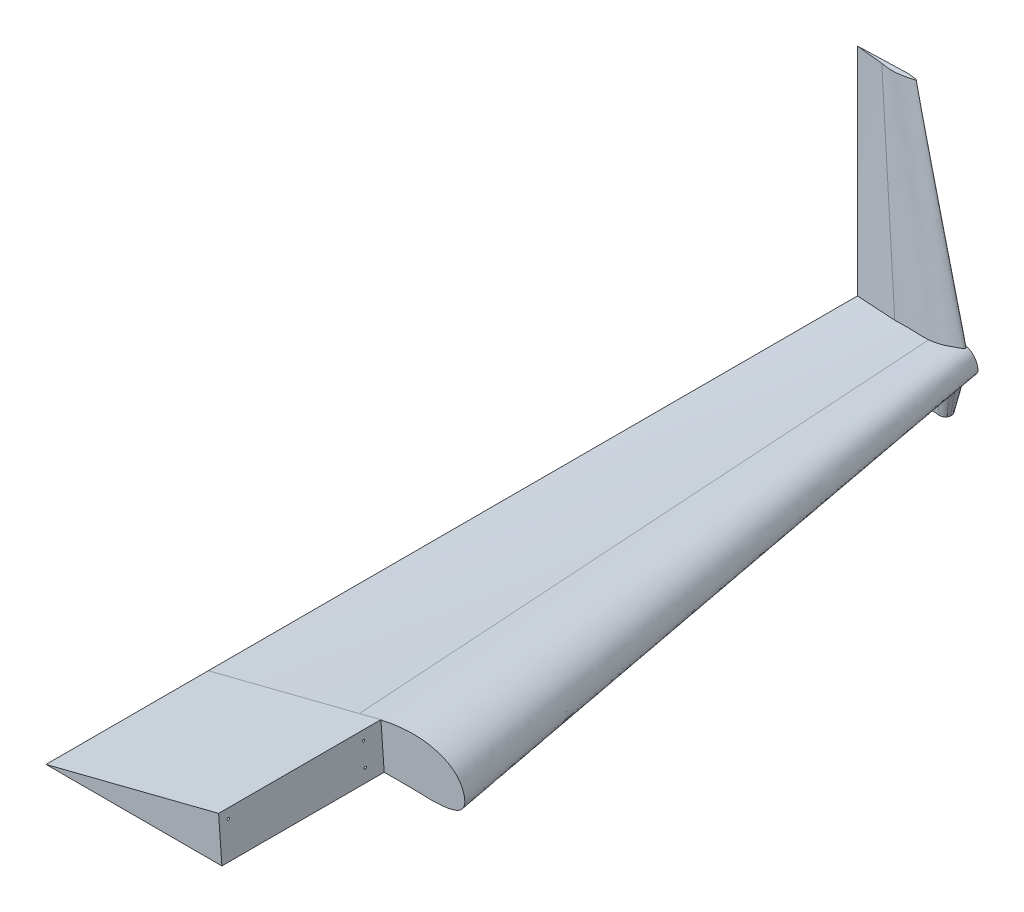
ISO-10303-21;
HEADER;
FILE_DESCRIPTION(('STEP AP214'),'2;1');
FILE_NAME('part.step','',(''),(''),'','','');
FILE_SCHEMA(('AUTOMOTIVE_DESIGN { 1 0 10303 214 1 1 1 1 }'));
ENDSEC;
DATA;
#1=APPLICATION_CONTEXT('core data for automotive mechanical design processes');
#2=APPLICATION_PROTOCOL_DEFINITION('international standard','automotive_design',2000,#1);
#3=PRODUCT_CONTEXT('',#1,'mechanical');
#4=PRODUCT('Part','Part','',(#3));
#5=PRODUCT_RELATED_PRODUCT_CATEGORY('part','',(#4));
#6=PRODUCT_DEFINITION_FORMATION('','',#4);
#7=PRODUCT_DEFINITION_CONTEXT('part definition',#1,'design');
#8=PRODUCT_DEFINITION('design','',#6,#7);
#9=PRODUCT_DEFINITION_SHAPE('','',#8);
#10=(LENGTH_UNIT() NAMED_UNIT(*) SI_UNIT(.MILLI.,.METRE.));
#11=(NAMED_UNIT(*) PLANE_ANGLE_UNIT() SI_UNIT($,.RADIAN.));
#12=(NAMED_UNIT(*) SI_UNIT($,.STERADIAN.) SOLID_ANGLE_UNIT());
#13=UNCERTAINTY_MEASURE_WITH_UNIT(LENGTH_MEASURE(1.E-05),#10,'distance_accuracy_value','');
#14=(GEOMETRIC_REPRESENTATION_CONTEXT(3) GLOBAL_UNCERTAINTY_ASSIGNED_CONTEXT((#13)) GLOBAL_UNIT_ASSIGNED_CONTEXT((#10,
#11,#12)) REPRESENTATION_CONTEXT('',''));
#15=CARTESIAN_POINT('',(0.,0.,0.));
#16=DIRECTION('',(0.,0.,1.));
#17=DIRECTION('',(1.,0.,0.));
#18=AXIS2_PLACEMENT_3D('',#15,#16,#17);
#19=CARTESIAN_POINT('',(1348.24319298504,226.973919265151,-1828.8));
#20=DIRECTION('',(0.,0.,1.));
#21=DIRECTION('',(-1.,0.,0.));
#22=AXIS2_PLACEMENT_3D('',#19,#20,#21);
#23=PLANE('',#22);
#24=DIRECTION('',(0.0744499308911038,-0.997224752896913,0.));
#25=VECTOR('',#24,1.);
#26=CARTESIAN_POINT('',(972.611845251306,247.366460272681,-1828.8));
#27=LINE('',#26,#25);
#28=CARTESIAN_POINT('',(972.709109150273,246.063652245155,-1828.8));
#29=VERTEX_POINT('',#28);
#30=CARTESIAN_POINT('',(991.079513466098,0.,-1828.8));
#31=VERTEX_POINT('',#30);
#32=EDGE_CURVE('E339',#29,#31,#27,.T.);
#33=ORIENTED_EDGE('',*,*,#32,.T.);
#34=DIRECTION('',(1.,0.,0.));
#35=VECTOR('',#34,1.);
#36=CARTESIAN_POINT('',(0.,0.,-1828.8));
#37=LINE('',#36,#35);
#38=CARTESIAN_POINT('',(1134.39192219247,0.,-1828.8));
#39=VERTEX_POINT('',#38);
#40=EDGE_CURVE('E370',#31,#39,#37,.T.);
#41=ORIENTED_EDGE('',*,*,#40,.T.);
#42=CARTESIAN_POINT('',(1134.39192219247,0.,-1828.8));
#43=CARTESIAN_POINT('',(1288.06456339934,-5.80362582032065,-1828.8));
#44=CARTESIAN_POINT('',(1484.66825155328,-13.2285925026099,-1828.8));
#45=CARTESIAN_POINT('',(1416.30744507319,198.082533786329,-1828.8));
#46=CARTESIAN_POINT('',(1196.82250870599,305.270953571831,-1828.8));
#47=CARTESIAN_POINT('',(997.437040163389,254.053338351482,-1828.8));
#48=CARTESIAN_POINT('',(850.875102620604,216.40489296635,-1828.8));
#49=B_SPLINE_CURVE_WITH_KNOTS('',3,(#42,#43,#44,#45,#46,#47,#48),.UNSPECIFIED.,.F.,.F.,(4,1,1,1,
4),(0.,0.319584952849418,0.40886640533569,0.565476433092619,1.),.UNSPECIFIED.);
#50=EDGE_CURVE('E344',#39,#29,#49,.T.);
#51=ORIENTED_EDGE('',*,*,#50,.T.);
#52=EDGE_LOOP('',(#33,#41,#51));
#53=FACE_BOUND('',#52,.T.);
#54=ADVANCED_FACE('F36',(#53),#23,.T.);
#55=CARTESIAN_POINT('',(662.699637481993,25.4413570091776,-5486.4));
#56=DIRECTION('',(0.,0.,-1.));
#57=DIRECTION('',(1.,0.,0.));
#58=AXIS2_PLACEMENT_3D('',#55,#56,#57);
#59=PLANE('',#58);
#60=CARTESIAN_POINT('',(611.221350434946,-54.5282599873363,-5486.4));
#61=CARTESIAN_POINT('',(612.418484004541,-49.8573170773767,-5486.4));
#62=CARTESIAN_POINT('',(613.605660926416,-45.1838161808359,-5486.4));
#63=CARTESIAN_POINT('',(615.958913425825,-35.8316138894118,-5486.4));
#64=CARTESIAN_POINT('',(617.124989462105,-31.1529126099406,-5486.4));
#65=CARTESIAN_POINT('',(619.367176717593,-22.0645454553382,-5486.4));
#66=CARTESIAN_POINT('',(620.444553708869,-17.6551919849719,-5486.40000000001));
#67=CARTESIAN_POINT('',(622.578717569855,-8.83141005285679,-5486.39999999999));
#68=CARTESIAN_POINT('',(623.635504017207,-4.41698148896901,-5486.39999999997));
#69=CARTESIAN_POINT('',(624.681530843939,0.,-5486.3999999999));
#70=B_SPLINE_CURVE_WITH_KNOTS('',3,(#60,#61,#62,#63,#64,#65,#66,#67,#68,#69),.UNSPECIFIED.,.F.,
.F.,(4,2,2,2,4),(0.,14.4657343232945,28.9311537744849,42.5483093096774,56.1657438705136),.UNSPECIFIED.);
#71=CARTESIAN_POINT('',(612.478645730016,-49.6071506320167,-5486.4));
#72=VERTEX_POINT('',#71);
#73=CARTESIAN_POINT('',(624.681530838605,0.,-5486.40000000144));
#74=VERTEX_POINT('',#73);
#75=EDGE_CURVE('E457',#72,#74,#70,.T.);
#76=ORIENTED_EDGE('',*,*,#75,.T.);
#77=CARTESIAN_POINT('',(624.681530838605,0.,-5486.40000000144));
#78=CARTESIAN_POINT('',(622.830253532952,7.51178090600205,-5486.4000000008));
#79=CARTESIAN_POINT('',(620.979223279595,15.0236226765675,-5486.40000000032));
#80=CARTESIAN_POINT('',(615.472954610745,37.3722986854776,-5486.39999999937));
#81=CARTESIAN_POINT('',(611.818432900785,52.209309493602,-5486.39999999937));
#82=CARTESIAN_POINT('',(608.164874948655,67.0465577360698,-5486.4));
#83=B_SPLINE_CURVE_WITH_KNOTS('',3,(#77,#78,#79,#80,#81,#82),.UNSPECIFIED.,.F.,.F.,(4,2,4),(0.,
23.2096255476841,69.0510017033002),.UNSPECIFIED.);
#84=CARTESIAN_POINT('',(609.542142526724,61.4535649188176,-5486.4));
#85=VERTEX_POINT('',#84);
#86=EDGE_CURVE('E179',#74,#85,#83,.T.);
#87=ORIENTED_EDGE('',*,*,#86,.T.);
#88=CARTESIAN_POINT('',(466.379689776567,55.88,-5486.4));
#89=CARTESIAN_POINT('',(491.178293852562,58.7091029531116,-5486.4));
#90=CARTESIAN_POINT('',(552.609469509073,65.7173651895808,-5486.4));
#91=CARTESIAN_POINT('',(653.431736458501,68.0619072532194,-5486.4));
#92=CARTESIAN_POINT('',(704.885602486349,-76.2197841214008,-5486.4));
#93=CARTESIAN_POINT('',(601.675341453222,-49.3104094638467,-5486.4));
#94=CARTESIAN_POINT('',(533.4,-31.5094008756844,-5486.4));
#95=B_SPLINE_CURVE_WITH_KNOTS('',3,(#88,#89,#90,#91,#92,#93,#94),.UNSPECIFIED.,.F.,.F.,(4,1,1,1,
4),(0.,0.187412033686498,0.464257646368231,0.645597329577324,1.),.UNSPECIFIED.);
#96=EDGE_CURVE('E383',#85,#72,#95,.T.);
#97=ORIENTED_EDGE('',*,*,#96,.T.);
#98=EDGE_LOOP('',(#76,#87,#97));
#99=FACE_BOUND('',#98,.T.);
#100=ADVANCED_FACE('F38',(#99),#59,.T.);
#101=DIRECTION('',(0.969146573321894,0.246485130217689,0.));
#102=VECTOR('',#101,1.);
#103=CARTESIAN_POINT('',(0.,0.,-1828.8));
#104=LINE('',#103,#102);
#105=CARTESIAN_POINT('',(850.875102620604,216.40489296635,-1828.8));
#106=VERTEX_POINT('',#105);
#107=CARTESIAN_POINT('',(903.944104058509,229.902046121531,-1828.8));
#108=VERTEX_POINT('',#107);
#109=EDGE_CURVE('E334',#106,#108,#104,.T.);
#110=ORIENTED_EDGE('',*,*,#109,.T.);
#111=EDGE_CURVE('E336',#108,#106,#49,.T.);
#112=ORIENTED_EDGE('',*,*,#111,.T.);
#113=EDGE_LOOP('',(#110,#112));
#114=FACE_BOUND('',#113,.T.);
#115=ADVANCED_FACE('F318',(#114),#23,.T.);
#116=CARTESIAN_POINT('',(0.,0.,-1828.8));
#117=CARTESIAN_POINT('',(0.,0.,-5486.4));
#118=CARTESIAN_POINT('',(1134.39192219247,0.,-1828.8));
#119=CARTESIAN_POINT('',(533.4,-31.5094008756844,-5486.4));
#120=B_SPLINE_SURFACE_WITH_KNOTS('',1,1,((#116,#117),(#118,#119)),.UNSPECIFIED.,.F.,.F.,.F.,(2,
2),(2,2),(0.,1.),(0.,1.),.UNSPECIFIED.);
#121=CARTESIAN_POINT('',(0.,0.,-5486.4));
#122=CARTESIAN_POINT('',(13.661686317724,-0.8070323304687,-5483.97584025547));
#123=CARTESIAN_POINT('',(27.3259063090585,-1.6108035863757,-5481.56488354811));
#124=CARTESIAN_POINT('',(54.6592453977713,-3.2119606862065,-5476.7687793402));
#125=CARTESIAN_POINT('',(68.3283644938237,-4.00934653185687,-5474.38363183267));
#126=CARTESIAN_POINT('',(97.1895483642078,-5.68607209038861,-5469.37507902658));
#127=CARTESIAN_POINT('',(112.382168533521,-6.56467941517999,-5466.75462884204));
#128=CARTESIAN_POINT('',(142.773047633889,-8.31436040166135,-5461.54406939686));
#129=CARTESIAN_POINT('',(157.971306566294,-9.18543406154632,-5458.95396014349));
#130=CARTESIAN_POINT('',(188.373506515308,-10.9202350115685,-5453.80328836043));
#131=CARTESIAN_POINT('',(203.5774476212,-11.7839621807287,-5451.24272631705));
#132=CARTESIAN_POINT('',(233.990564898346,-13.5042204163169,-5446.15047797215));
#133=CARTESIAN_POINT('',(249.199741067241,-14.3607514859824,-5443.61879165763));
#134=CARTESIAN_POINT('',(264.411442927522,-15.213767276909,-5441.10118491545));
#135=B_SPLINE_CURVE_WITH_KNOTS('',3,(#121,#122,#123,#124,#125,#126,#127,#128,#129,#130,#131,
#132,#133,#134),.UNSPECIFIED.,.F.,.F.,(4,2,2,2,2,2,4),(0.,41.6956223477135,83.3912334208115,
129.717107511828,176.042992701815,222.369639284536,268.696265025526),.UNSPECIFIED.);
#136=CARTESIAN_POINT('',(0.,0.,-5486.4));
#137=VERTEX_POINT('',#136);
#138=CARTESIAN_POINT('',(264.411442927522,-15.2137672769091,-5441.10118491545));
#139=VERTEX_POINT('',#138);
#140=EDGE_CURVE('E523',#137,#139,#135,.T.);
#141=CARTESIAN_POINT('',(264.411442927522,-15.2137672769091,-5441.10118491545));
#142=CARTESIAN_POINT('',(267.635754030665,-15.3965668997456,-5440.79316267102));
#143=CARTESIAN_POINT('',(270.860073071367,-15.5792693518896,-5440.48514758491));
#144=CARTESIAN_POINT('',(277.308500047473,-15.9444413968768,-5439.86667964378));
#145=CARTESIAN_POINT('',(280.532607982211,-16.1269109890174,-5439.55622678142));
#146=CARTESIAN_POINT('',(286.980680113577,-16.4915954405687,-5438.93040257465));
#147=CARTESIAN_POINT('',(290.204644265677,-16.6738102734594,-5438.61503075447));
#148=CARTESIAN_POINT('',(296.65186392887,-17.0379236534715,-5437.97695042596));
#149=CARTESIAN_POINT('',(299.875119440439,-17.2198222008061,-5437.65424192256));
#150=CARTESIAN_POINT('',(306.320742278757,-17.5832605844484,-5436.99904519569));
#151=CARTESIAN_POINT('',(309.54310958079,-17.7648004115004,-5436.66655672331));
#152=CARTESIAN_POINT('',(315.986588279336,-18.1274654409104,-5435.98939502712));
#153=CARTESIAN_POINT('',(319.207699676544,-18.3085906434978,-5435.64472181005));
#154=CARTESIAN_POINT('',(325.648144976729,-18.6703592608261,-5434.94083127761));
#155=CARTESIAN_POINT('',(328.867478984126,-18.8510027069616,-5434.58161493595));
#156=CARTESIAN_POINT('',(335.304262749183,-19.2117615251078,-5433.84627177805));
#157=CARTESIAN_POINT('',(338.521712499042,-19.3918768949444,-5433.47014489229));
#158=CARTESIAN_POINT('',(344.704255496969,-19.7375332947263,-5432.72868012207));
#159=CARTESIAN_POINT('',(347.669518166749,-19.9031185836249,-5432.36477741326));
#160=CARTESIAN_POINT('',(353.597818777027,-20.2337337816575,-5431.61887993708));
#161=CARTESIAN_POINT('',(356.560856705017,-20.3987636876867,-5431.23688506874));
#162=CARTESIAN_POINT('',(362.484346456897,-20.7282114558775,-5430.45309197));
#163=CARTESIAN_POINT('',(365.444798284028,-20.8926293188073,-5430.05129376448));
#164=CARTESIAN_POINT('',(371.362762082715,-21.2207957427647,-5429.22624752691));
#165=CARTESIAN_POINT('',(374.320274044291,-21.3845443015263,-5428.80299942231));
#166=CARTESIAN_POINT('',(380.23303868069,-21.7113704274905,-5427.9332502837));
#167=CARTESIAN_POINT('',(383.188290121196,-21.8744477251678,-5427.48674073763));
#168=CARTESIAN_POINT('',(389.095061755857,-22.1998116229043,-5426.56924464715));
#169=CARTESIAN_POINT('',(392.046581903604,-22.3620982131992,-5426.09825780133));
#170=CARTESIAN_POINT('',(397.947241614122,-22.6860621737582,-5425.14120438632));
#171=CARTESIAN_POINT('',(400.89638113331,-22.8477395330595,-5424.65513754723));
#172=CARTESIAN_POINT('',(406.793619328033,-23.1706741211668,-5423.67691658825));
#173=CARTESIAN_POINT('',(409.741718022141,-23.3319313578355,-5423.18476258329));
#174=CARTESIAN_POINT('',(412.690048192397,-23.4930775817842,-5422.69404778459));
#175=B_SPLINE_CURVE_WITH_KNOTS('',3,(#141,#142,#143,#144,#145,#146,#147,#148,#149,#150,#151,
#152,#153,#154,#155,#156,#157,#158,#159,#160,#161,#162,#163,#164,#165,#166,#167,#168,#169,#170,
#171,#172,#173,#174),.UNSPECIFIED.,.F.,.F.,(4,2,2,2,2,2,2,2,2,2,2,2,2,2,2,2,4),(0.,
9.73243733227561,19.4649039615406,29.1983177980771,38.93172507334,48.6653802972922,
58.3990301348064,68.1320293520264,77.8650685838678,86.84130076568,95.8175830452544,
104.793854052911,113.770155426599,122.749764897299,131.729484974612,140.709365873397,
149.689077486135),.UNSPECIFIED.);
#176=CARTESIAN_POINT('',(412.690048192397,-23.4930775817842,-5422.69404778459));
#177=VERTEX_POINT('',#176);
#178=EDGE_CURVE('E11',#139,#177,#175,.T.);
#179=CARTESIAN_POINT('',(412.690048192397,-23.4930775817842,-5422.69404778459));
#180=CARTESIAN_POINT('',(414.837539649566,-23.610454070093,-5422.33661765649));
#181=CARTESIAN_POINT('',(416.98515958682,-23.7277728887,-5421.97994092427));
#182=CARTESIAN_POINT('',(421.281240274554,-23.9623794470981,-5421.27153281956));
#183=CARTESIAN_POINT('',(423.42970103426,-24.079667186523,-5420.91980150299));
#184=CARTESIAN_POINT('',(429.87986071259,-24.4317543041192,-5419.87675705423));
#185=CARTESIAN_POINT('',(434.183627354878,-24.6666296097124,-5419.19805335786));
#186=CARTESIAN_POINT('',(442.800973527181,-25.1372833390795,-5417.90228342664));
#187=CARTESIAN_POINT('',(447.114554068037,-25.3730618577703,-5417.28522386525));
#188=CARTESIAN_POINT('',(455.752048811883,-25.8460753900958,-5416.14218847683));
#189=CARTESIAN_POINT('',(460.075957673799,-26.0833097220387,-5415.61617295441));
#190=CARTESIAN_POINT('',(466.961854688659,-26.4622874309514,-5414.87620971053));
#191=CARTESIAN_POINT('',(469.519629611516,-26.6033167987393,-5414.62272079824));
#192=CARTESIAN_POINT('',(474.639509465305,-26.886263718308,-5414.16455250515));
#193=CARTESIAN_POINT('',(477.20161433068,-27.0281812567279,-5413.95987239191));
#194=CARTESIAN_POINT('',(482.329297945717,-27.3129995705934,-5413.60605743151));
#195=CARTESIAN_POINT('',(484.894876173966,-27.4559002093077,-5413.45691501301));
#196=CARTESIAN_POINT('',(490.034946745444,-27.743140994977,-5413.22073676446));
#197=CARTESIAN_POINT('',(492.609445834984,-27.8874837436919,-5413.1338483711));
#198=CARTESIAN_POINT('',(497.760278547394,-28.1773797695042,-5413.0297884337));
#199=CARTESIAN_POINT('',(500.33661239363,-28.3229332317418,-5413.01262775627));
#200=CARTESIAN_POINT('',(505.49013385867,-28.6153688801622,-5413.05512471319));
#201=CARTESIAN_POINT('',(508.067321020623,-28.7622518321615,-5413.11482984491));
#202=CARTESIAN_POINT('',(510.643050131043,-28.9097797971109,-5413.2165208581));
#203=B_SPLINE_CURVE_WITH_KNOTS('',3,(#179,#180,#181,#182,#183,#184,#185,#186,#187,#188,#189,
#190,#191,#192,#193,#194,#195,#196,#197,#198,#199,#200,#201,#202),.UNSPECIFIED.,.F.,.F.,(4,2,2,
2,2,2,2,2,2,2,2,4),(0.,6.54058364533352,13.0812411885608,26.1708134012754,39.2618011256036,
52.3470666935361,60.0691959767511,67.7912093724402,75.5121696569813,83.2513556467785,
90.9917476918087,98.7369250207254),.UNSPECIFIED.);
#204=CARTESIAN_POINT('',(510.643050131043,-28.9097797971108,-5413.2165208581));
#205=VERTEX_POINT('',#204);
#206=EDGE_CURVE('E48',#177,#205,#203,.T.);
#207=CARTESIAN_POINT('',(510.643050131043,-28.9097797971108,-5413.2165208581));
#208=CARTESIAN_POINT('',(511.599743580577,-28.9646161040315,-5413.25667634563));
#209=CARTESIAN_POINT('',(512.556158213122,-29.0195521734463,-5413.30349636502));
#210=CARTESIAN_POINT('',(514.467028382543,-29.1295542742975,-5413.41080918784));
#211=CARTESIAN_POINT('',(515.421484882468,-29.1846200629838,-5413.47128511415));
#212=CARTESIAN_POINT('',(517.328409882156,-29.2948901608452,-5413.60628078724));
#213=CARTESIAN_POINT('',(518.280879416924,-29.3500942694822,-5413.6807860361));
#214=CARTESIAN_POINT('',(520.183797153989,-29.4606493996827,-5413.84420532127));
#215=CARTESIAN_POINT('',(521.134246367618,-29.5160002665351,-5413.93310766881));
#216=CARTESIAN_POINT('',(523.033091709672,-29.6268574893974,-5414.1256839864));
#217=CARTESIAN_POINT('',(523.981488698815,-29.6823637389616,-5414.22934951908));
#218=CARTESIAN_POINT('',(525.876197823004,-29.7935403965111,-5414.45181201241));
#219=CARTESIAN_POINT('',(526.822510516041,-29.8492107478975,-5414.57060424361));
#220=CARTESIAN_POINT('',(528.713224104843,-29.9607364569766,-5414.82370474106));
#221=CARTESIAN_POINT('',(529.657624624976,-30.0165918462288,-5414.95801580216));
#222=CARTESIAN_POINT('',(531.544241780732,-30.1284824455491,-5415.24248291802));
#223=CARTESIAN_POINT('',(532.486457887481,-30.1845176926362,-5415.39264246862));
#224=CARTESIAN_POINT('',(534.368641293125,-30.2967749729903,-5415.70915193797));
#225=CARTESIAN_POINT('',(535.308607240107,-30.3529970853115,-5415.87550987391));
#226=CARTESIAN_POINT('',(537.18622617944,-30.4656351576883,-5416.22475657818));
#227=CARTESIAN_POINT('',(538.123876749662,-30.5220512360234,-5416.40765833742));
#228=CARTESIAN_POINT('',(539.996802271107,-30.6350844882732,-5416.79033134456));
#229=CARTESIAN_POINT('',(540.932073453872,-30.6917018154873,-5416.99012100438));
#230=CARTESIAN_POINT('',(542.8001763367,-30.8051446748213,-5417.40689621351));
#231=CARTESIAN_POINT('',(543.733002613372,-30.8619703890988,-5417.62390601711));
#232=CARTESIAN_POINT('',(544.663752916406,-30.9188536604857,-5417.84949017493));
#233=B_SPLINE_CURVE_WITH_KNOTS('',3,(#207,#208,#209,#210,#211,#212,#213,#214,#215,#216,#217,
#218,#219,#220,#221,#222,#223,#224,#225,#226,#227,#228,#229,#230,#231,#232),.UNSPECIFIED.,.F.,
.F.,(4,2,2,2,2,2,2,2,2,2,2,2,4),(0.,2.87730067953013,5.75106462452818,8.62187495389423,
11.4903660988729,14.3572243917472,17.2231885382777,20.0896696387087,22.9567843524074,
25.8253253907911,28.6961388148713,31.5701235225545,34.4482306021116),.UNSPECIFIED.);
#234=CARTESIAN_POINT('',(544.663752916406,-30.9188536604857,-5417.84949017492));
#235=VERTEX_POINT('',#234);
#236=EDGE_CURVE('E211',#205,#235,#233,.T.);
#237=DIRECTION('',(-0.162133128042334,-0.00850047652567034,-0.986732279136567));
#238=VECTOR('',#237,1.);
#239=CARTESIAN_POINT('',(833.895961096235,-15.7547004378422,-3657.6));
#240=LINE('',#239,#238);
#241=EDGE_CURVE('E366',#39,#235,#240,.T.);
#242=CARTESIAN_POINT('',(0.,0.,-1828.8));
#243=VERTEX_POINT('',#242);
#244=EDGE_CURVE('E351',#243,#31,#37,.T.);
#245=DIRECTION('',(0.,0.,1.));
#246=VECTOR('',#245,1.);
#247=CARTESIAN_POINT('',(0.,0.,-3657.6));
#248=LINE('',#247,#246);
#249=EDGE_CURVE('E391',#137,#243,#248,.T.);
#250=ORIENTED_EDGE('',*,*,#140,.T.);
#251=ORIENTED_EDGE('',*,*,#178,.T.);
#252=ORIENTED_EDGE('',*,*,#206,.T.);
#253=ORIENTED_EDGE('',*,*,#236,.T.);
#254=ORIENTED_EDGE('',*,*,#241,.F.);
#255=ORIENTED_EDGE('',*,*,#40,.F.);
#256=ORIENTED_EDGE('',*,*,#244,.F.);
#257=ORIENTED_EDGE('',*,*,#249,.F.);
#258=EDGE_LOOP('',(#250,#251,#252,#253,#254,#255,#256,#257));
#259=FACE_BOUND('',#258,.T.);
#260=ADVANCED_FACE('F233',(#259),#120,.F.);
#261=CARTESIAN_POINT('',(1134.39192219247,0.,-1828.8));
#262=CARTESIAN_POINT('',(533.4,-31.5094008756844,-5486.4));
#263=CARTESIAN_POINT('',(1288.06456339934,-5.80362582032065,-1828.8));
#264=CARTESIAN_POINT('',(594.967740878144,-47.5615781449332,-5486.4));
#265=CARTESIAN_POINT('',(1458.47932770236,-12.2395373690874,-1828.8));
#266=CARTESIAN_POINT('',(663.243082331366,-65.3625867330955,-5486.4));
#267=CARTESIAN_POINT('',(1441.82428679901,119.207037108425,-1828.8));
#268=CARTESIAN_POINT('',(679.579722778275,-30.3421010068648,-5486.4));
#269=CARTESIAN_POINT('',(1409.51983757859,193.366333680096,-1828.8));
#270=CARTESIAN_POINT('',(678.995781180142,-3.62218367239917,-5486.4));
#271=CARTESIAN_POINT('',(1346.58045482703,232.13464699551,-1828.8));
#272=CARTESIAN_POINT('',(663.300828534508,29.3096513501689,-5486.4));
#273=CARTESIAN_POINT('',(1215.07457653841,274.576196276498,-1828.8));
#274=CARTESIAN_POINT('',(620.468565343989,67.2953747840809,-5486.4));
#275=CARTESIAN_POINT('',(1060.64988491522,270.291287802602,-1828.8));
#276=CARTESIAN_POINT('',(548.67501743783,65.2685104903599,-5486.4));
#277=CARTESIAN_POINT('',(914.087947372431,232.64284241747,-1828.8));
#278=CARTESIAN_POINT('',(491.178293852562,58.7091029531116,-5486.4));
#279=CARTESIAN_POINT('',(850.875102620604,216.40489296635,-1828.8));
#280=CARTESIAN_POINT('',(466.379689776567,55.88,-5486.4));
#281=B_SPLINE_SURFACE_WITH_KNOTS('',3,1,((#261,#262),(#263,#264),(#265,#266),(#267,#268),(#269,
#270),(#271,#272),(#273,#274),(#275,#276),(#277,#278),(#279,#280)),.UNSPECIFIED.,.F.,.F.,.F.,(4,
1,1,1,1,1,1,4),(2,2),(0.,0.319584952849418,0.354402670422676,0.40886640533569,0.535742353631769,
0.565476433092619,0.812587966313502,1.),(0.,1.),.UNSPECIFIED.);
#282=CARTESIAN_POINT('',(604.197049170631,-46.4836872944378,-5450.49104085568));
#283=CARTESIAN_POINT('',(604.513744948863,-46.5586709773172,-5450.78277520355));
#284=CARTESIAN_POINT('',(604.828993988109,-46.6330345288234,-5451.07624423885));
#285=CARTESIAN_POINT('',(605.456482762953,-46.780503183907,-5451.66690216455));
#286=CARTESIAN_POINT('',(605.768721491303,-46.8536078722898,-5451.96409222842));
#287=CARTESIAN_POINT('',(606.3899242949,-46.9985050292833,-5452.56230774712));
#288=CARTESIAN_POINT('',(606.698887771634,-47.0702972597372,-5452.86333388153));
#289=CARTESIAN_POINT('',(607.313244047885,-47.2125147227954,-5453.46936596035));
#290=CARTESIAN_POINT('',(607.618636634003,-47.2829398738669,-5453.77437214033));
#291=CARTESIAN_POINT('',(608.229003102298,-47.4231660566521,-5454.39205060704));
#292=CARTESIAN_POINT('',(608.533932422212,-47.4929507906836,-5454.7047706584));
#293=CARTESIAN_POINT('',(609.139447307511,-47.6310087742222,-5455.33467474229));
#294=CARTESIAN_POINT('',(609.440033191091,-47.699282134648,-5455.65185844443));
#295=CARTESIAN_POINT('',(610.036454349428,-47.8342587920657,-5456.2909446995));
#296=CARTESIAN_POINT('',(610.332290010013,-47.9009622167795,-5456.61284686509));
#297=CARTESIAN_POINT('',(610.91875211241,-48.0327385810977,-5457.26167299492));
#298=CARTESIAN_POINT('',(611.20937874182,-48.097811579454,-5457.58859677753));
#299=CARTESIAN_POINT('',(611.801050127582,-48.2298684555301,-5458.26632400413));
#300=CARTESIAN_POINT('',(612.101762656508,-48.2967542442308,-5458.61743703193));
#301=CARTESIAN_POINT('',(612.696012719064,-48.4285425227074,-5459.32608950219));
#302=CARTESIAN_POINT('',(612.989549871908,-48.4934449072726,-5459.68362928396));
#303=CARTESIAN_POINT('',(613.568551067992,-48.6211685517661,-5460.40566691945));
#304=CARTESIAN_POINT('',(613.854013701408,-48.6839894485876,-5460.7701659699));
#305=CARTESIAN_POINT('',(614.415811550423,-48.8074451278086,-5461.50678193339));
#306=CARTESIAN_POINT('',(614.692142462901,-48.8680788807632,-5461.87890230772));
#307=CARTESIAN_POINT('',(615.23311816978,-48.9867597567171,-5462.62978516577));
#308=CARTESIAN_POINT('',(615.497803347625,-49.0448158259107,-5463.00851706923));
#309=CARTESIAN_POINT('',(616.014877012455,-49.1584098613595,-5463.77464414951));
#310=CARTESIAN_POINT('',(616.26726628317,-49.2139479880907,-5464.16203877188));
#311=CARTESIAN_POINT('',(616.757483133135,-49.3222663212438,-5464.94602154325));
#312=CARTESIAN_POINT('',(616.99531921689,-49.375048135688,-5465.34260413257));
#313=CARTESIAN_POINT('',(617.453774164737,-49.4775970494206,-5466.14576246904));
#314=CARTESIAN_POINT('',(617.674401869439,-49.5273656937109,-5466.55233294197));
#315=CARTESIAN_POINT('',(618.066648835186,-49.617066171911,-5467.32070139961));
#316=CARTESIAN_POINT('',(618.240861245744,-49.6574182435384,-5467.68112133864));
#317=CARTESIAN_POINT('',(618.571056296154,-49.7353424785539,-5468.41058798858));
#318=CARTESIAN_POINT('',(618.72703764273,-49.7729144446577,-5468.77963530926));
#319=CARTESIAN_POINT('',(619.017078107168,-49.844875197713,-5469.52630087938));
#320=CARTESIAN_POINT('',(619.151156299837,-49.8792667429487,-5469.90391134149));
#321=CARTESIAN_POINT('',(619.332557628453,-49.92811706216,-5470.47674795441));
#322=CARTESIAN_POINT('',(619.38973823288,-49.943944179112,-5470.66876153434));
#323=CARTESIAN_POINT('',(619.496876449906,-49.9746137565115,-5471.05487855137));
#324=CARTESIAN_POINT('',(619.546834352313,-49.9894562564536,-5471.24898190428));
#325=CARTESIAN_POINT('',(619.631853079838,-50.0159070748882,-5471.60960667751));
#326=CARTESIAN_POINT('',(619.668024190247,-50.0276648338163,-5471.77585488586));
#327=CARTESIAN_POINT('',(619.734170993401,-50.0503527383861,-5472.10962605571));
#328=CARTESIAN_POINT('',(619.764146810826,-50.0612829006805,-5472.27714899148));
#329=CARTESIAN_POINT('',(619.844288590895,-50.092771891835,-5472.78134296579));
#330=CARTESIAN_POINT('',(619.884688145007,-50.1120351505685,-5473.11971953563));
#331=CARTESIAN_POINT('',(619.937139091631,-50.1467818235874,-5473.79849376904));
#332=CARTESIAN_POINT('',(619.949221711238,-50.1622693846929,-5474.13888879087));
#333=CARTESIAN_POINT('',(619.943485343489,-50.1892412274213,-5474.81963709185));
#334=CARTESIAN_POINT('',(619.925665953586,-50.2007254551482,-5475.15999037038));
#335=CARTESIAN_POINT('',(619.85916624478,-50.2195542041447,-5475.83947721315));
#336=CARTESIAN_POINT('',(619.810335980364,-50.226878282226,-5476.17859675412));
#337=CARTESIAN_POINT('',(619.681918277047,-50.2372172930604,-5476.85101116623));
#338=CARTESIAN_POINT('',(619.602331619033,-50.2402323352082,-5477.18430618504));
#339=CARTESIAN_POINT('',(619.413626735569,-50.2419825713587,-5477.84259424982));
#340=CARTESIAN_POINT('',(619.30449363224,-50.2407156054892,-5478.16758302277));
#341=CARTESIAN_POINT('',(619.058833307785,-50.2340281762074,-5478.80697019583));
#342=CARTESIAN_POINT('',(618.922302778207,-50.2286072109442,-5479.12136731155));
#343=CARTESIAN_POINT('',(618.592117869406,-50.2122077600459,-5479.80510977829));
#344=CARTESIAN_POINT('',(618.392497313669,-50.200277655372,-5480.17155120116));
#345=CARTESIAN_POINT('',(617.961756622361,-50.1710210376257,-5480.88516605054));
#346=CARTESIAN_POINT('',(617.730627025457,-50.1536929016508,-5481.2323336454));
#347=CARTESIAN_POINT('',(617.240905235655,-50.1140436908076,-5481.90857737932));
#348=CARTESIAN_POINT('',(616.982199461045,-50.091701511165,-5482.23756949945));
#349=CARTESIAN_POINT('',(616.442737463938,-50.0425388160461,-5482.87641436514));
#350=CARTESIAN_POINT('',(616.161983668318,-50.0157187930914,-5483.18626921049));
#351=CARTESIAN_POINT('',(615.611276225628,-49.9609071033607,-5483.75785138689));
#352=CARTESIAN_POINT('',(615.343051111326,-49.9333009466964,-5484.0212926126));
#353=CARTESIAN_POINT('',(614.794168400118,-49.8750664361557,-5484.53454415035));
#354=CARTESIAN_POINT('',(614.513509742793,-49.844437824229,-5484.78435329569));
#355=CARTESIAN_POINT('',(613.945233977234,-49.7807858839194,-5485.26833479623));
#356=CARTESIAN_POINT('',(613.657742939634,-49.7477961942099,-5485.50266032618));
#357=CARTESIAN_POINT('',(613.074242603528,-49.6793093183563,-5485.9597376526));
#358=CARTESIAN_POINT('',(612.778238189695,-49.6438135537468,-5486.18249588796));
#359=CARTESIAN_POINT('',(612.478645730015,-49.6071506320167,-5486.4));
#360=B_SPLINE_CURVE_WITH_KNOTS('',3,(#282,#283,#284,#285,#286,#287,#288,#289,#290,#291,#292,
#293,#294,#295,#296,#297,#298,#299,#300,#301,#302,#303,#304,#305,#306,#307,#308,#309,#310,#311,
#312,#313,#314,#315,#316,#317,#318,#319,#320,#321,#322,#323,#324,#325,#326,#327,#328,#329,#330,
#331,#332,#333,#334,#335,#336,#337,#338,#339,#340,#341,#342,#343,#344,#345,#346,#347,#348,#349,
#350,#351,#352,#353,#354,#355,#356,#357,#358,#359),.UNSPECIFIED.,.F.,.F.,(4,2,2,2,2,2,2,2,2,2,2,
2,2,2,2,2,2,2,2,2,2,2,2,2,2,2,2,2,2,2,2,2,2,2,2,2,2,2,4),(0.,1.31119988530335,2.62282424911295,
3.93468430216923,5.246622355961,6.57353430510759,7.9003485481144,9.22705447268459,
10.5537125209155,11.9549167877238,13.3561952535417,14.7577168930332,16.1598898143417,
17.5567393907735,18.9534998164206,20.3494360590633,21.744650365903,22.9512409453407,
24.1579170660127,25.3635366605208,25.9663334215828,26.5691059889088,27.0806209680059,
27.5921256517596,28.6148871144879,29.6365201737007,30.6581669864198,31.6847917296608,
32.7113904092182,33.7385069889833,34.7657476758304,36.0161897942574,37.267008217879,
38.5231936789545,39.779241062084,40.9096557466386,42.0401670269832,43.1569348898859,
44.2730742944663),.UNSPECIFIED.);
#361=CARTESIAN_POINT('',(604.197049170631,-46.4836872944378,-5450.49104085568));
#362=VERTEX_POINT('',#361);
#363=EDGE_CURVE('E252',#362,#72,#360,.T.);
#364=CARTESIAN_POINT('',(609.542142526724,61.4535649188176,-5486.4));
#365=CARTESIAN_POINT('',(609.841700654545,61.4014388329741,-5486.24257531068));
#366=CARTESIAN_POINT('',(610.139641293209,61.3489074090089,-5486.08216704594));
#367=CARTESIAN_POINT('',(610.732864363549,61.2430927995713,-5485.75415749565));
#368=CARTESIAN_POINT('',(611.028132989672,61.1898075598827,-5485.58653192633));
#369=CARTESIAN_POINT('',(611.614997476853,61.0828184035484,-5485.24364849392));
#370=CARTESIAN_POINT('',(611.906584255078,61.0291138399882,-5485.06837524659));
#371=CARTESIAN_POINT('',(612.485003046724,60.921687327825,-5484.70964538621));
#372=CARTESIAN_POINT('',(612.771831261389,60.8679653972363,-5484.52618262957));
#373=CARTESIAN_POINT('',(613.345760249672,60.7598044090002,-5484.14633838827));
#374=CARTESIAN_POINT('',(613.632735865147,60.7053745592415,-5483.94976461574));
#375=CARTESIAN_POINT('',(614.199310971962,60.597538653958,-5483.54648279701));
#376=CARTESIAN_POINT('',(614.478916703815,60.5441317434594,-5483.33978377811));
#377=CARTESIAN_POINT('',(615.029353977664,60.4390088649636,-5482.91516946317));
#378=CARTESIAN_POINT('',(615.300194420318,60.3872911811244,-5482.69726616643));
#379=CARTESIAN_POINT('',(615.831554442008,60.286329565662,-5482.24887744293));
#380=CARTESIAN_POINT('',(616.092079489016,60.2370843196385,-5482.01839884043));
#381=CARTESIAN_POINT('',(616.493344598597,60.1621231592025,-5481.64367650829));
#382=CARTESIAN_POINT('',(616.638232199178,60.1352488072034,-5481.5040931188));
#383=CARTESIAN_POINT('',(616.923347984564,60.0828924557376,-5481.21995845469));
#384=CARTESIAN_POINT('',(617.063575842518,60.0574105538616,-5481.07540683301));
#385=CARTESIAN_POINT('',(617.338771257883,60.0081007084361,-5480.78108022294));
#386=CARTESIAN_POINT('',(617.473738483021,59.9842728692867,-5480.63130490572));
#387=CARTESIAN_POINT('',(617.737389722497,59.9386217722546,-5480.32668203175));
#388=CARTESIAN_POINT('',(617.866088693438,59.9167936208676,-5480.17184818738));
#389=CARTESIAN_POINT('',(618.116798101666,59.8753934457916,-5479.85655071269));
#390=CARTESIAN_POINT('',(618.238808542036,59.8558214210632,-5479.69608708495));
#391=CARTESIAN_POINT('',(618.475291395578,59.8192779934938,-5479.36937603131));
#392=CARTESIAN_POINT('',(618.589763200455,59.8023068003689,-5479.20312814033));
#393=CARTESIAN_POINT('',(618.81215801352,59.7710607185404,-5478.86182475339));
#394=CARTESIAN_POINT('',(618.919930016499,59.7568386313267,-5478.68666566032));
#395=CARTESIAN_POINT('',(619.125613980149,59.7318663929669,-5478.33038955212));
#396=CARTESIAN_POINT('',(619.22352587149,59.721116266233,-5478.14927249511));
#397=CARTESIAN_POINT('',(619.408390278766,59.7034767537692,-5477.78131907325));
#398=CARTESIAN_POINT('',(619.495342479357,59.696587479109,-5477.59448254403));
#399=CARTESIAN_POINT('',(619.657012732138,59.6870367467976,-5477.21598845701));
#400=CARTESIAN_POINT('',(619.731759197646,59.6843653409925,-5477.02434332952));
#401=CARTESIAN_POINT('',(619.868289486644,59.6835095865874,-5476.63645783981));
#402=CARTESIAN_POINT('',(619.930073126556,59.6853253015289,-5476.44021741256));
#403=CARTESIAN_POINT('',(620.039863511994,59.6936364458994,-5476.04408087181));
#404=CARTESIAN_POINT('',(620.08787426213,59.7001305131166,-5475.84418583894));
#405=CARTESIAN_POINT('',(620.181409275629,59.7204488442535,-5475.38348026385));
#406=CARTESIAN_POINT('',(620.222204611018,59.7358491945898,-5475.12176134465));
#407=CARTESIAN_POINT('',(620.279621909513,59.774411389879,-5474.59631311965));
#408=CARTESIAN_POINT('',(620.296246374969,59.7975724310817,-5474.3325840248));
#409=CARTESIAN_POINT('',(620.305880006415,59.8511799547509,-5473.80523448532));
#410=CARTESIAN_POINT('',(620.298869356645,59.8816325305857,-5473.54161431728));
#411=CARTESIAN_POINT('',(620.262509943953,59.9490550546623,-5473.0167846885));
#412=CARTESIAN_POINT('',(620.233157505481,59.9860260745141,-5472.75557563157));
#413=CARTESIAN_POINT('',(620.144279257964,60.0752850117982,-5472.17403984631));
#414=CARTESIAN_POINT('',(620.079148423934,60.1291108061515,-5471.85479784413));
#415=CARTESIAN_POINT('',(619.960712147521,60.2150092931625,-5471.3822347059));
#416=CARTESIAN_POINT('',(619.91776295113,60.2445103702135,-5471.22572404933));
#417=CARTESIAN_POINT('',(619.825435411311,60.3050325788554,-5470.91489827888));
#418=CARTESIAN_POINT('',(619.776057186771,60.3360536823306,-5470.76058312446));
#419=CARTESIAN_POINT('',(619.671295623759,60.399472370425,-5470.45389581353));
#420=CARTESIAN_POINT('',(619.615898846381,60.4318729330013,-5470.30152889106));
#421=CARTESIAN_POINT('',(619.499802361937,60.4977648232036,-5469.99907809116));
#422=CARTESIAN_POINT('',(619.439102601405,60.5312561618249,-5469.84899423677));
#423=CARTESIAN_POINT('',(619.249847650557,60.6330781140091,-5469.40211890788));
#424=CARTESIAN_POINT('',(619.114118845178,60.7027674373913,-5469.10865223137));
#425=CARTESIAN_POINT('',(618.874472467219,60.8211079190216,-5468.62571012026));
#426=CARTESIAN_POINT('',(618.774853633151,60.869105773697,-5468.43390029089));
#427=CARTESIAN_POINT('',(618.569413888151,60.9658976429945,-5468.05382253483));
#428=CARTESIAN_POINT('',(618.46359265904,61.0146916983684,-5467.86555479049));
#429=CARTESIAN_POINT('',(618.137724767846,61.1619841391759,-5467.3054255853));
#430=CARTESIAN_POINT('',(617.909438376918,61.2613119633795,-5466.93856384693));
#431=CARTESIAN_POINT('',(617.435098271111,61.4608143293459,-5466.21617792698));
#432=CARTESIAN_POINT('',(617.189022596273,61.5609897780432,-5465.86066856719));
#433=CARTESIAN_POINT('',(616.682483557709,61.7610742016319,-5465.15991647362));
#434=CARTESIAN_POINT('',(616.422017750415,61.8609831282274,-5464.8146754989));
#435=CARTESIAN_POINT('',(615.887370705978,62.060437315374,-5464.13102883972));
#436=CARTESIAN_POINT('',(615.613110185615,62.1599758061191,-5463.79268342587));
#437=CARTESIAN_POINT('',(615.054608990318,62.3573739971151,-5463.12446188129));
#438=CARTESIAN_POINT('',(614.770378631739,62.4552352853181,-5462.7945775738));
#439=CARTESIAN_POINT('',(614.19324087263,62.6489365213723,-5462.14217407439));
#440=CARTESIAN_POINT('',(613.900337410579,62.7447773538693,-5461.81965165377));
#441=CARTESIAN_POINT('',(613.306908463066,62.9341707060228,-5461.1811166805));
#442=CARTESIAN_POINT('',(613.006384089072,63.0277235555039,-5460.8651031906));
#443=CARTESIAN_POINT('',(612.298267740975,63.2428015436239,-5460.13553941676));
#444=CARTESIAN_POINT('',(611.888079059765,63.3633664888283,-5459.72422619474));
#445=CARTESIAN_POINT('',(611.057450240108,63.5997072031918,-5458.91064788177));
#446=CARTESIAN_POINT('',(610.637009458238,63.7154826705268,-5458.50838336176));
#447=CARTESIAN_POINT('',(609.786868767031,63.9420858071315,-5457.71160798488));
#448=CARTESIAN_POINT('',(609.357161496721,64.0529093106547,-5457.31710380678));
#449=CARTESIAN_POINT('',(608.489879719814,64.2693505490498,-5456.53537983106));
#450=CARTESIAN_POINT('',(608.052305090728,64.3749682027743,-5456.14816014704));
#451=CARTESIAN_POINT('',(607.169648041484,64.5810233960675,-5455.3799051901));
#452=CARTESIAN_POINT('',(606.72455755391,64.6814548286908,-5454.99887755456));
#453=CARTESIAN_POINT('',(605.828079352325,64.8769653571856,-5454.24291531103));
#454=CARTESIAN_POINT('',(605.376691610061,64.972044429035,-5453.86798073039));
#455=CARTESIAN_POINT('',(604.013314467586,65.2493794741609,-5452.75103954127));
#456=CARTESIAN_POINT('',(603.092758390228,65.4235825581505,-5452.01745577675));
#457=CARTESIAN_POINT('',(601.232653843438,65.7507935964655,-5450.57000973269));
#458=CARTESIAN_POINT('',(600.293105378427,65.9038015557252,-5449.85614744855));
#459=CARTESIAN_POINT('',(598.398356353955,66.1891111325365,-5448.44675511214));
#460=CARTESIAN_POINT('',(597.443167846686,66.3214279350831,-5447.75121193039));
#461=CARTESIAN_POINT('',(596.000036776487,66.5049805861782,-5446.72065776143));
#462=CARTESIAN_POINT('',(595.517467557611,66.563656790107,-5446.37940323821));
#463=CARTESIAN_POINT('',(594.548935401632,66.6761663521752,-5445.70092953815));
#464=CARTESIAN_POINT('',(594.062972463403,66.7299997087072,-5445.36371036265));
#465=CARTESIAN_POINT('',(593.088003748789,66.8329021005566,-5444.69349000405));
#466=CARTESIAN_POINT('',(592.598999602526,66.8819734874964,-5444.36048681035));
#467=CARTESIAN_POINT('',(591.617723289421,66.9754847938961,-5443.69867763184));
#468=CARTESIAN_POINT('',(591.125451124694,67.0199247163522,-5443.36987164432));
#469=CARTESIAN_POINT('',(589.643988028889,67.146434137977,-5442.39006404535));
#470=CARTESIAN_POINT('',(588.649925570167,67.2217169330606,-5441.7455180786));
#471=CARTESIAN_POINT('',(586.649056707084,67.3550136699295,-5440.47457526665));
#472=CARTESIAN_POINT('',(585.642249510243,67.4130265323,-5439.8481795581));
#473=CARTESIAN_POINT('',(583.382945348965,67.5240915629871,-5438.47236995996));
#474=CARTESIAN_POINT('',(582.127258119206,67.5729254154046,-5437.7278424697));
#475=CARTESIAN_POINT('',(579.597271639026,67.6473518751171,-5436.2688056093));
#476=CARTESIAN_POINT('',(578.322965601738,67.6729357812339,-5435.55430757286));
#477=CARTESIAN_POINT('',(575.756514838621,67.702502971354,-5434.15670982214));
#478=CARTESIAN_POINT('',(574.464364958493,67.7064798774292,-5433.47361943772));
#479=CARTESIAN_POINT('',(571.863099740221,67.6945460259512,-5432.14005945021));
#480=CARTESIAN_POINT('',(570.553980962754,67.6786311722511,-5431.48959659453));
#481=CARTESIAN_POINT('',(567.919731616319,67.6287100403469,-5430.22234247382));
#482=CARTESIAN_POINT('',(566.59459949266,67.5947019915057,-5429.6055545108));
#483=CARTESIAN_POINT('',(563.929372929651,67.5104847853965,-5428.40653588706));
#484=CARTESIAN_POINT('',(562.589279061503,67.4602762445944,-5427.82430391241));
#485=CARTESIAN_POINT('',(559.893792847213,67.3455879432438,-5426.69449968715));
#486=CARTESIAN_POINT('',(558.538388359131,67.2810959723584,-5426.14695760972));
#487=CARTESIAN_POINT('',(556.49546672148,67.1752514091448,-5425.35243352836));
#488=CARTESIAN_POINT('',(555.812885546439,67.1384538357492,-5425.09206725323));
#489=CARTESIAN_POINT('',(554.444524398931,67.0620945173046,-5424.58028507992));
#490=CARTESIAN_POINT('',(553.758744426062,67.0225327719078,-5424.32886918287));
#491=CARTESIAN_POINT('',(552.384153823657,66.9409313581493,-5423.83503971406));
#492=CARTESIAN_POINT('',(551.695343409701,66.8988918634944,-5423.59262551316));
#493=CARTESIAN_POINT('',(550.314757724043,66.8126081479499,-5423.11680030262));
#494=CARTESIAN_POINT('',(549.622982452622,66.768363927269,-5422.88338929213));
#495=CARTESIAN_POINT('',(548.236650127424,66.6776907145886,-5422.42557379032));
#496=CARTESIAN_POINT('',(547.542093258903,66.6312618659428,-5422.20116870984));
#497=CARTESIAN_POINT('',(546.150296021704,66.5362504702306,-5421.76133174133));
#498=CARTESIAN_POINT('',(545.453055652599,66.4876679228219,-5421.54589985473));
#499=CARTESIAN_POINT('',(543.357638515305,66.3387466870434,-5420.91306438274));
#500=CARTESIAN_POINT('',(541.955610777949,66.2352242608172,-5420.50906984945));
#501=CARTESIAN_POINT('',(539.14267911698,66.0200155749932,-5419.7366258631));
#502=CARTESIAN_POINT('',(537.73177654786,65.908330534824,-5419.3681711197));
#503=CARTESIAN_POINT('',(534.620991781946,65.6541769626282,-5418.5966337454));
#504=CARTESIAN_POINT('',(532.919347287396,65.509998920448,-5418.20119848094));
#505=CARTESIAN_POINT('',(529.506252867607,65.2110699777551,-5417.45974321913));
#506=CARTESIAN_POINT('',(527.79480281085,65.0563189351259,-5417.11372388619));
#507=CARTESIAN_POINT('',(524.363419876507,64.7369648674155,-5416.46989436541));
#508=CARTESIAN_POINT('',(522.643485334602,64.5723598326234,-5416.17209405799));
#509=CARTESIAN_POINT('',(519.19648756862,64.2340878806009,-5415.62337669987));
#510=CARTESIAN_POINT('',(517.469422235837,64.0604180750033,-5415.37247471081));
#511=CARTESIAN_POINT('',(514.009524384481,63.7048682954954,-5414.91610628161));
#512=CARTESIAN_POINT('',(512.276690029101,63.5229854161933,-5414.71065607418));
#513=CARTESIAN_POINT('',(508.806629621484,63.1519159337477,-5414.34362850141));
#514=CARTESIAN_POINT('',(507.069402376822,62.9627270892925,-5414.18206472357));
#515=CARTESIAN_POINT('',(503.592797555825,62.5780929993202,-5413.90120972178));
#516=CARTESIAN_POINT('',(501.85342082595,62.3826497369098,-5413.78190524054));
#517=CARTESIAN_POINT('',(498.373087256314,61.9864119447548,-5413.58364002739));
#518=CARTESIAN_POINT('',(496.632130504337,61.7856176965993,-5413.50467717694));
#519=CARTESIAN_POINT('',(493.149998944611,61.3796926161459,-5413.38513393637));
#520=CARTESIAN_POINT('',(491.408824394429,61.1745632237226,-5413.34454100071));
#521=CARTESIAN_POINT('',(487.927616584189,60.7609990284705,-5413.29966034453));
#522=CARTESIAN_POINT('',(486.187583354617,60.5525665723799,-5413.29534791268));
#523=CARTESIAN_POINT('',(482.71002666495,60.1334359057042,-5413.32085164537));
#524=CARTESIAN_POINT('',(480.972502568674,59.9227404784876,-5413.35062978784));
#525=CARTESIAN_POINT('',(477.50130313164,59.5001135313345,-5413.44204955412));
#526=CARTESIAN_POINT('',(475.767626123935,59.2881845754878,-5413.5036393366));
#527=CARTESIAN_POINT('',(474.034688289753,59.075923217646,-5413.58008687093));
#528=B_SPLINE_CURVE_WITH_KNOTS('',3,(#364,#365,#366,#367,#368,#369,#370,#371,#372,#373,#374,
#375,#376,#377,#378,#379,#380,#381,#382,#383,#384,#385,#386,#387,#388,#389,#390,#391,#392,#393,
#394,#395,#396,#397,#398,#399,#400,#401,#402,#403,#404,#405,#406,#407,#408,#409,#410,#411,#412,
#413,#414,#415,#416,#417,#418,#419,#420,#421,#422,#423,#424,#425,#426,#427,#428,#429,#430,#431,
#432,#433,#434,#435,#436,#437,#438,#439,#440,#441,#442,#443,#444,#445,#446,#447,#448,#449,#450,
#451,#452,#453,#454,#455,#456,#457,#458,#459,#460,#461,#462,#463,#464,#465,#466,#467,#468,#469,
#470,#471,#472,#473,#474,#475,#476,#477,#478,#479,#480,#481,#482,#483,#484,#485,#486,#487,#488,
#489,#490,#491,#492,#493,#494,#495,#496,#497,#498,#499,#500,#501,#502,#503,#504,#505,#506,#507,
#508,#509,#510,#511,#512,#513,#514,#515,#516,#517,#518,#519,#520,#521,#522,#523,#524,#525,#526,
#527),.UNSPECIFIED.,.F.,.F.,(4,2,2,2,2,2,2,2,2,2,2,2,2,2,2,2,2,2,2,2,2,2,2,2,2,2,2,2,2,2,2,2,2,
2,2,2,2,2,2,2,2,2,2,2,2,2,2,2,2,2,2,2,2,2,2,2,2,2,2,2,2,2,2,2,2,2,2,2,2,2,2,2,2,2,2,2,2,2,2,2,2,
4),(0.,1.02719699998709,2.05817165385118,3.09132559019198,4.12526804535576,5.18130541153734,
6.23641780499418,7.29042284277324,8.34386148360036,8.95268185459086,9.56154484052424,
10.1704462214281,10.7778153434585,11.3851841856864,11.9926019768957,12.6107268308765,
13.2288560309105,13.8470030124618,14.4636898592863,15.0803854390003,15.6969015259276,
16.4915994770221,17.2862151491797,18.0814971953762,18.8769101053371,19.8659149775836,
20.3606729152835,20.8554217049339,21.3512988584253,21.8471810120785,22.8387790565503,
23.5028825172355,24.1670200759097,25.4964144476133,26.8274788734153,28.1587700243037,
29.4988615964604,30.8376051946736,32.1757499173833,33.5137005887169,35.293299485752,
37.0730103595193,38.8541912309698,40.6353998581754,42.418660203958,44.20192855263,
47.7710716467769,51.3402139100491,54.906724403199,56.6885248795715,58.4703259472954,
60.2512425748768,62.032158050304,65.5931671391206,69.1543987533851,73.5356669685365,
77.9185741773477,82.302775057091,86.6878788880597,91.0734119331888,95.4587781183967,
99.8479077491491,102.042290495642,104.236673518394,106.430902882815,108.625132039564,
110.819217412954,113.013303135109,117.400984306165,121.788011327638,127.045983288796,
132.304025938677,137.563144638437,142.823949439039,148.086630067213,153.350938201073,
158.613593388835,163.875972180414,169.136629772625,174.393703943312,179.644920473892,
184.887606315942),.UNSPECIFIED.);
#529=CARTESIAN_POINT('',(474.034688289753,59.0759232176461,-5413.58008687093));
#530=VERTEX_POINT('',#529);
#531=EDGE_CURVE('E181',#85,#530,#528,.T.);
#532=DIRECTION('',(-0.104446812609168,-0.0436060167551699,-0.993574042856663));
#533=VECTOR('',#532,1.);
#534=CARTESIAN_POINT('',(658.627396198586,136.142446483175,-3657.6));
#535=LINE('',#534,#533);
#536=EDGE_CURVE('E388',#106,#530,#535,.T.);
#537=EDGE_CURVE('E350',#29,#108,#49,.T.);
#538=CARTESIAN_POINT('',(544.663752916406,-30.9188536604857,-5417.84949017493));
#539=CARTESIAN_POINT('',(545.618638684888,-31.1706579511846,-5418.10116003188));
#540=CARTESIAN_POINT('',(546.571043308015,-31.4224202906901,-5418.36231518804));
#541=CARTESIAN_POINT('',(548.470525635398,-31.9255846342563,-5418.90383937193));
#542=CARTESIAN_POINT('',(549.417603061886,-32.1769866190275,-5419.18420939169));
#543=CARTESIAN_POINT('',(551.305980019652,-32.6791310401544,-5419.76438442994));
#544=CARTESIAN_POINT('',(552.247279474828,-32.9298734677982,-5420.06418970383));
#545=CARTESIAN_POINT('',(554.12001715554,-33.4294304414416,-5420.68220156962));
#546=CARTESIAN_POINT('',(555.051479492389,-33.6782486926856,-5421.0003320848));
#547=CARTESIAN_POINT('',(556.907805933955,-34.1746448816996,-5421.65617010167));
#548=CARTESIAN_POINT('',(557.832670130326,-34.4222228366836,-5421.99387733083));
#549=CARTESIAN_POINT('',(559.675389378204,-34.9158509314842,-5422.68895167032));
#550=CARTESIAN_POINT('',(560.593244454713,-35.1619010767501,-5423.04631871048));
#551=CARTESIAN_POINT('',(562.435771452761,-35.6560032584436,-5423.7864658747));
#552=CARTESIAN_POINT('',(563.360326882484,-35.9040267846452,-5424.16955512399));
#553=CARTESIAN_POINT('',(565.201360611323,-36.3978999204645,-5424.95602984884));
#554=CARTESIAN_POINT('',(566.117838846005,-36.6437495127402,-5425.35941548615));
#555=CARTESIAN_POINT('',(567.942294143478,-37.1329729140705,-5426.18641034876));
#556=CARTESIAN_POINT('',(568.850271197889,-37.3763467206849,-5426.610019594));
#557=CARTESIAN_POINT('',(570.660892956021,-37.8612778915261,-5427.47905289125));
#558=CARTESIAN_POINT('',(571.563502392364,-38.1028242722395,-5427.9245565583));
#559=CARTESIAN_POINT('',(573.35935931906,-38.5828256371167,-5428.83565284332));
#560=CARTESIAN_POINT('',(574.252606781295,-38.821280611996,-5429.30124552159));
#561=CARTESIAN_POINT('',(576.02938560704,-39.2948100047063,-5430.25228909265));
#562=CARTESIAN_POINT('',(576.912916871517,-39.5298843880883,-5430.73774018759));
#563=CARTESIAN_POINT('',(577.791405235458,-39.7631218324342,-5431.23300100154));
#564=B_SPLINE_CURVE_WITH_KNOTS('',3,(#538,#539,#540,#541,#542,#543,#544,#545,#546,#547,#548,
#549,#550,#551,#552,#553,#554,#555,#556,#557,#558,#559,#560,#561,#562,#563),.UNSPECIFIED.,.F.,
.F.,(4,2,2,2,2,2,2,2,2,2,2,2,4),(0.,3.05724169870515,6.11464135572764,9.1720811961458,
12.2176336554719,15.2631437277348,18.3086429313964,21.4015772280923,24.4945361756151,
27.5874981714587,30.692686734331,33.7978846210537,36.9031141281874),.UNSPECIFIED.);
#565=CARTESIAN_POINT('',(577.791405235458,-39.7631218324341,-5431.23300100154));
#566=VERTEX_POINT('',#565);
#567=EDGE_CURVE('E267',#235,#566,#564,.T.);
#568=CARTESIAN_POINT('',(577.791405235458,-39.7631218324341,-5431.23300100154));
#569=CARTESIAN_POINT('',(578.476955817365,-39.9451342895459,-5431.6194788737));
#570=CARTESIAN_POINT('',(579.159355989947,-40.1260156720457,-5432.01204636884));
#571=CARTESIAN_POINT('',(580.517710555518,-40.4853863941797,-5432.80923654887));
#572=CARTESIAN_POINT('',(581.193664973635,-40.6638757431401,-5433.21385918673));
#573=CARTESIAN_POINT('',(583.211467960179,-41.195515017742,-5434.44551712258));
#574=CARTESIAN_POINT('',(584.543442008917,-41.5448855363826,-5435.2904471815));
#575=CARTESIAN_POINT('',(587.179780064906,-42.2324701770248,-5437.02661101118));
#576=CARTESIAN_POINT('',(588.484144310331,-42.5706843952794,-5437.91784438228));
#577=CARTESIAN_POINT('',(590.419291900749,-43.0688919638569,-5439.28820494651));
#578=CARTESIAN_POINT('',(591.06080567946,-43.2334500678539,-5439.75060046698));
#579=CARTESIAN_POINT('',(592.336620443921,-43.5594112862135,-5440.68634666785));
#580=CARTESIAN_POINT('',(592.970921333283,-43.7208143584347,-5441.15969749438));
#581=CARTESIAN_POINT('',(594.516047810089,-44.1122486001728,-5442.332564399));
#582=CARTESIAN_POINT('',(595.42285414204,-44.3404758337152,-5443.03799488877));
#583=CARTESIAN_POINT('',(596.771392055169,-44.6773852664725,-5444.11245511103));
#584=CARTESIAN_POINT('',(597.218967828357,-44.7887852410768,-5444.47333461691));
#585=CARTESIAN_POINT('',(598.110217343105,-45.0097337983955,-5445.20044706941));
#586=CARTESIAN_POINT('',(598.553891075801,-45.1192823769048,-5445.5666800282));
#587=CARTESIAN_POINT('',(599.437384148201,-45.3364984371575,-5446.30440381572));
#588=CARTESIAN_POINT('',(599.877203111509,-45.444165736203,-5446.67589514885));
#589=CARTESIAN_POINT('',(600.752823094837,-45.6575509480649,-5447.42413176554));
#590=CARTESIAN_POINT('',(601.18862413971,-45.7632688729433,-5447.80087701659));
#591=CARTESIAN_POINT('',(602.055917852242,-45.9726742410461,-5448.55983343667));
#592=CARTESIAN_POINT('',(602.487410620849,-46.0763617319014,-5448.94204447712));
#593=CARTESIAN_POINT('',(603.345777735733,-46.2816276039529,-5449.71219055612));
#594=CARTESIAN_POINT('',(603.772652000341,-46.3832059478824,-5450.1001256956));
#595=CARTESIAN_POINT('',(604.197049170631,-46.4836872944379,-5450.49104085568));
#596=B_SPLINE_CURVE_WITH_KNOTS('',3,(#568,#569,#570,#571,#572,#573,#574,#575,#576,#577,#578,
#579,#580,#581,#582,#583,#584,#585,#586,#587,#588,#589,#590,#591,#592,#593,#594,#595),
.UNSPECIFIED.,.F.,.F.,(4,2,2,2,2,2,2,2,2,2,2,2,2,4),(0.,2.42321482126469,4.84642019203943,
9.69217464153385,14.5378872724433,16.9609821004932,19.3841092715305,22.8977213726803,
24.654594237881,26.4114710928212,28.1685176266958,29.9255532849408,31.6825476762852,
33.4395730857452),.UNSPECIFIED.);
#597=EDGE_CURVE('E260',#566,#362,#596,.T.);
#598=ORIENTED_EDGE('',*,*,#363,.T.);
#599=ORIENTED_EDGE('',*,*,#96,.F.);
#600=ORIENTED_EDGE('',*,*,#531,.T.);
#601=ORIENTED_EDGE('',*,*,#536,.F.);
#602=ORIENTED_EDGE('',*,*,#111,.F.);
#603=ORIENTED_EDGE('',*,*,#537,.F.);
#604=ORIENTED_EDGE('',*,*,#50,.F.);
#605=ORIENTED_EDGE('',*,*,#241,.T.);
#606=ORIENTED_EDGE('',*,*,#567,.T.);
#607=ORIENTED_EDGE('',*,*,#597,.T.);
#608=EDGE_LOOP('',(#598,#599,#600,#601,#602,#603,#604,#605,#606,#607));
#609=FACE_BOUND('',#608,.T.);
#610=ADVANCED_FACE('F226',(#609),#281,.F.);
#611=CARTESIAN_POINT('',(850.875102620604,216.40489296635,-1828.8));
#612=CARTESIAN_POINT('',(466.379689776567,55.88,-5486.4));
#613=CARTESIAN_POINT('',(0.,0.,-1828.8));
#614=CARTESIAN_POINT('',(0.,0.,-5486.4));
#615=B_SPLINE_SURFACE_WITH_KNOTS('',1,1,((#611,#612),(#613,#614)),.UNSPECIFIED.,.F.,.F.,.F.,(2,
2),(2,2),(0.,1.),(0.,1.),.UNSPECIFIED.);
#616=CARTESIAN_POINT('',(254.957782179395,31.309383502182,-5441.45102309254));
#617=CARTESIAN_POINT('',(233.640371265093,28.6289720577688,-5445.18406754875));
#618=CARTESIAN_POINT('',(212.322200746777,25.9638974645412,-5448.92378092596));
#619=CARTESIAN_POINT('',(169.684287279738,20.6648232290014,-5456.41623741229));
#620=CARTESIAN_POINT('',(148.364544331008,18.0308235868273,-5460.16898052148));
#621=CARTESIAN_POINT('',(84.6992676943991,10.2124370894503,-5471.39403457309));
#622=CARTESIAN_POINT('',(42.3513408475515,5.07439246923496,-5478.88507542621));
#623=CARTESIAN_POINT('',(0.,0.,-5486.4));
#624=B_SPLINE_CURVE_WITH_KNOTS('',3,(#616,#617,#618,#619,#620,#621,#622,#623),.UNSPECIFIED.,.F.,
.F.,(4,2,2,4),(0.,65.4214719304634,130.842944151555,260.776423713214),.UNSPECIFIED.);
#625=CARTESIAN_POINT('',(254.957782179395,31.3093835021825,-5441.45102309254));
#626=VERTEX_POINT('',#625);
#627=EDGE_CURVE('E268',#626,#137,#624,.T.);
#628=DIRECTION('',(0.969146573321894,0.246485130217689,0.));
#629=VECTOR('',#628,1.);
#630=CARTESIAN_POINT('',(0.,0.,-1828.8));
#631=LINE('',#630,#629);
#632=EDGE_CURVE('E340',#243,#106,#631,.T.);
#633=CARTESIAN_POINT('',(474.034688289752,59.075923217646,-5413.58008687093));
#634=CARTESIAN_POINT('',(471.931823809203,58.8110078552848,-5413.67257903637));
#635=CARTESIAN_POINT('',(469.830065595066,58.5455964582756,-5413.78696106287));
#636=CARTESIAN_POINT('',(465.631859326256,58.0143358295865,-5414.05549144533));
#637=CARTESIAN_POINT('',(463.535407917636,57.7484875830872,-5414.20958907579));
#638=CARTESIAN_POINT('',(459.3473177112,57.2164555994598,-5414.55364800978));
#639=CARTESIAN_POINT('',(457.255676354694,56.9502723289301,-5414.74357920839));
#640=CARTESIAN_POINT('',(453.076664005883,56.4176550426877,-5415.15553171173));
#641=CARTESIAN_POINT('',(450.989291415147,56.1512212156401,-5415.37753712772));
#642=CARTESIAN_POINT('',(446.818300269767,55.6181821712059,-5415.84996573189));
#643=CARTESIAN_POINT('',(444.734680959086,55.3515770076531,-5416.10038234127));
#644=CARTESIAN_POINT('',(440.570685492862,54.8182667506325,-5416.6260502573));
#645=CARTESIAN_POINT('',(438.490309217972,54.5515616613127,-5416.901300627));
#646=CARTESIAN_POINT('',(434.331979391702,54.0180755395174,-5417.47317086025));
#647=CARTESIAN_POINT('',(432.254026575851,53.7512945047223,-5417.76979604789));
#648=CARTESIAN_POINT('',(428.100414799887,53.2177619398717,-5418.38092157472));
#649=CARTESIAN_POINT('',(426.024756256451,52.9510104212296,-5418.69542474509));
#650=CARTESIAN_POINT('',(421.875302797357,52.4175971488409,-5419.33889302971));
#651=CARTESIAN_POINT('',(419.801508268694,52.150935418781,-5419.66786065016));
#652=CARTESIAN_POINT('',(415.655358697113,51.61775657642,-5420.3368776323));
#653=CARTESIAN_POINT('',(413.583003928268,51.3512394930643,-5420.6769287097));
#654=CARTESIAN_POINT('',(409.439313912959,50.8183995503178,-5421.36475367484));
#655=CARTESIAN_POINT('',(407.367978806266,50.5520767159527,-5421.71252842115));
#656=CARTESIAN_POINT('',(403.225910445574,50.0196697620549,-5422.41245141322));
#657=CARTESIAN_POINT('',(401.155177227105,49.7535856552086,-5422.76459987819));
#658=CARTESIAN_POINT('',(397.094495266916,49.2320475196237,-5423.45619188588));
#659=CARTESIAN_POINT('',(395.10454114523,48.9765830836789,-5423.79559610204));
#660=CARTESIAN_POINT('',(391.124253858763,48.4659189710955,-5424.47239170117));
#661=CARTESIAN_POINT('',(389.133920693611,48.2107192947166,-5424.80978308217));
#662=CARTESIAN_POINT('',(385.152606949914,47.7006248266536,-5425.47952793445));
#663=CARTESIAN_POINT('',(383.161626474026,47.4457300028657,-5425.81188198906));
#664=CARTESIAN_POINT('',(380.174136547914,47.0636012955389,-5426.30438770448));
#665=CARTESIAN_POINT('',(379.178137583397,46.9362607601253,-5426.46755190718));
#666=CARTESIAN_POINT('',(377.185743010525,46.6816518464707,-5426.79149789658));
#667=CARTESIAN_POINT('',(376.189347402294,46.5543834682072,-5426.95227968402));
#668=CARTESIAN_POINT('',(374.196252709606,46.2999400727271,-5427.27101001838));
#669=CARTESIAN_POINT('',(373.19955369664,46.172765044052,-5427.42895900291));
#670=CARTESIAN_POINT('',(371.205702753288,45.9184880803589,-5427.74203129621));
#671=CARTESIAN_POINT('',(370.208550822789,45.791386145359,-5427.89715460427));
#672=CARTESIAN_POINT('',(367.216442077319,45.4101881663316,-5428.35840055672));
#673=CARTESIAN_POINT('',(365.220834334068,45.1562002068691,-5428.66039890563));
#674=CARTESIAN_POINT('',(361.228177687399,44.6485264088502,-5429.25384045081));
#675=CARTESIAN_POINT('',(359.231128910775,44.3948405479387,-5429.54528448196));
#676=CARTESIAN_POINT('',(355.235561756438,43.8877435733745,-5430.11814585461));
#677=CARTESIAN_POINT('',(353.237043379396,43.6343324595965,-5430.3995632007));
#678=CARTESIAN_POINT('',(347.239492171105,42.8745028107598,-5431.2295341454));
#679=CARTESIAN_POINT('',(343.238427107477,42.3684833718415,-5431.76381200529));
#680=CARTESIAN_POINT('',(335.231675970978,41.3574302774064,-5432.79855237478));
#681=CARTESIAN_POINT('',(331.225989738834,40.8523966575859,-5433.29901368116));
#682=CARTESIAN_POINT('',(323.212111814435,39.8434115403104,-5434.27039487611));
#683=CARTESIAN_POINT('',(319.203921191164,39.3394597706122,-5434.74132332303));
#684=CARTESIAN_POINT('',(311.184262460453,38.3323804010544,-5435.65842868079));
#685=CARTESIAN_POINT('',(307.172794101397,37.8292528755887,-5436.1046034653));
#686=CARTESIAN_POINT('',(299.147114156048,36.8237407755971,-5436.97694172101));
#687=CARTESIAN_POINT('',(295.13290230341,36.3213562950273,-5437.40310284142));
#688=CARTESIAN_POINT('',(287.102279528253,35.3172629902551,-5438.24026172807));
#689=CARTESIAN_POINT('',(283.085868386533,34.8155542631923,-5438.65125750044));
#690=CARTESIAN_POINT('',(275.051399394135,33.8127584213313,-5439.46301739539));
#691=CARTESIAN_POINT('',(271.033341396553,33.3116713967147,-5439.86378016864));
#692=CARTESIAN_POINT('',(262.996131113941,32.3100830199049,-5440.66008011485));
#693=CARTESIAN_POINT('',(258.976978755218,31.8095817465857,-5441.0556166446));
#694=CARTESIAN_POINT('',(254.957782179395,31.3093835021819,-5441.45102309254));
#695=B_SPLINE_CURVE_WITH_KNOTS('',3,(#633,#634,#635,#636,#637,#638,#639,#640,#641,#642,#643,
#644,#645,#646,#647,#648,#649,#650,#651,#652,#653,#654,#655,#656,#657,#658,#659,#660,#661,#662,
#663,#664,#665,#666,#667,#668,#669,#670,#671,#672,#673,#674,#675,#676,#677,#678,#679,#680,#681,
#682,#683,#684,#685,#686,#687,#688,#689,#690,#691,#692,#693,#694),.UNSPECIFIED.,.F.,.F.,(4,2,2,
2,2,2,2,2,2,2,2,2,2,2,2,2,2,2,2,2,2,2,2,2,2,2,2,2,2,2,4),(0.,6.36427843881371,12.7204682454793,
19.0713416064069,25.4190796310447,31.7653507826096,38.1113825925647,44.4590005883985,
50.8076266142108,57.157357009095,63.5080750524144,69.8595026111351,76.2112497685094,
82.3156231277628,88.4200024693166,94.5236694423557,97.5754975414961,100.627324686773,
103.678676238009,106.73002854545,112.832739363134,118.934966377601,125.037190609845,
137.241528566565,149.446300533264,161.647519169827,173.849784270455,186.053479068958,
198.258772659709,210.46566742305,222.674050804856),.UNSPECIFIED.);
#696=EDGE_CURVE('E342',#530,#626,#695,.T.);
#697=ORIENTED_EDGE('',*,*,#627,.T.);
#698=ORIENTED_EDGE('',*,*,#249,.T.);
#699=ORIENTED_EDGE('',*,*,#632,.T.);
#700=ORIENTED_EDGE('',*,*,#536,.T.);
#701=ORIENTED_EDGE('',*,*,#696,.T.);
#702=EDGE_LOOP('',(#697,#698,#699,#700,#701));
#703=FACE_BOUND('',#702,.T.);
#704=ADVANCED_FACE('F232',(#703),#615,.F.);
#705=CARTESIAN_POINT('',(991.079513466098,0.,-1828.8));
#706=DIRECTION('',(0.,0.,-1.));
#707=DIRECTION('',(1.,0.,0.));
#708=AXIS2_PLACEMENT_3D('',#705,#706,#707);
#709=PLANE('',#708);
#710=ORIENTED_EDGE('',*,*,#537,.T.);
#711=CARTESIAN_POINT('',(972.611845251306,247.366460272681,-1828.8));
#712=VERTEX_POINT('',#711);
#713=EDGE_CURVE('E359',#108,#712,#104,.T.);
#714=ORIENTED_EDGE('',*,*,#713,.T.);
#715=EDGE_CURVE('E375',#712,#29,#27,.T.);
#716=ORIENTED_EDGE('',*,*,#715,.T.);
#717=EDGE_LOOP('',(#710,#714,#716));
#718=FACE_BOUND('',#717,.T.);
#719=ADVANCED_FACE('F417',(#718),#709,.T.);
#720=CARTESIAN_POINT('',(991.079513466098,0.,-914.4));
#721=DIRECTION('',(0.,1.,0.));
#722=DIRECTION('',(0.,0.,-1.));
#723=AXIS2_PLACEMENT_3D('',#720,#721,#722);
#724=PLANE('',#723);
#725=ORIENTED_EDGE('',*,*,#244,.T.);
#726=DIRECTION('',(0.,0.,-1.));
#727=VECTOR('',#726,1.);
#728=CARTESIAN_POINT('',(991.079513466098,0.,-914.4));
#729=LINE('',#728,#727);
#730=CARTESIAN_POINT('',(991.079513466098,0.,-914.4));
#731=VERTEX_POINT('',#730);
#732=EDGE_CURVE('E382',#731,#31,#729,.T.);
#733=ORIENTED_EDGE('',*,*,#732,.F.);
#734=DIRECTION('',(-1.,0.,0.));
#735=VECTOR('',#734,1.);
#736=CARTESIAN_POINT('',(991.079513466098,0.,-914.4));
#737=LINE('',#736,#735);
#738=CARTESIAN_POINT('',(0.,0.,-914.4));
#739=VERTEX_POINT('',#738);
#740=EDGE_CURVE('E219',#731,#739,#737,.T.);
#741=ORIENTED_EDGE('',*,*,#740,.T.);
#742=DIRECTION('',(0.,0.,-1.));
#743=VECTOR('',#742,1.);
#744=CARTESIAN_POINT('',(0.,0.,-914.4));
#745=LINE('',#744,#743);
#746=EDGE_CURVE('E381',#739,#243,#745,.T.);
#747=ORIENTED_EDGE('',*,*,#746,.T.);
#748=EDGE_LOOP('',(#725,#733,#741,#747));
#749=FACE_BOUND('',#748,.T.);
#750=ADVANCED_FACE('F426',(#749),#724,.F.);
#751=CARTESIAN_POINT('',(0.,0.,-914.4));
#752=DIRECTION('',(0.246485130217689,-0.969146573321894,0.));
#753=DIRECTION('',(0.969146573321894,0.246485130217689,0.));
#754=AXIS2_PLACEMENT_3D('',#751,#752,#753);
#755=PLANE('',#754);
#756=ORIENTED_EDGE('',*,*,#632,.F.);
#757=ORIENTED_EDGE('',*,*,#746,.F.);
#758=DIRECTION('',(0.969146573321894,0.246485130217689,0.));
#759=VECTOR('',#758,1.);
#760=CARTESIAN_POINT('',(0.,0.,-914.4));
#761=LINE('',#760,#759);
#762=CARTESIAN_POINT('',(972.611845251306,247.366460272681,-914.4));
#763=VERTEX_POINT('',#762);
#764=EDGE_CURVE('E784',#739,#763,#761,.T.);
#765=ORIENTED_EDGE('',*,*,#764,.T.);
#766=DIRECTION('',(0.,0.,-1.));
#767=VECTOR('',#766,1.);
#768=CARTESIAN_POINT('',(972.611845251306,247.366460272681,-914.4));
#769=LINE('',#768,#767);
#770=EDGE_CURVE('E380',#763,#712,#769,.T.);
#771=ORIENTED_EDGE('',*,*,#770,.T.);
#772=ORIENTED_EDGE('',*,*,#713,.F.);
#773=ORIENTED_EDGE('',*,*,#109,.F.);
#774=EDGE_LOOP('',(#756,#757,#765,#771,#772,#773));
#775=FACE_BOUND('',#774,.T.);
#776=ADVANCED_FACE('F428',(#775),#755,.F.);
#777=CARTESIAN_POINT('',(972.611845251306,247.366460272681,-914.4));
#778=DIRECTION('',(-0.997224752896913,-0.0744499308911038,0.));
#779=DIRECTION('',(0.0744499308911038,-0.997224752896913,0.));
#780=AXIS2_PLACEMENT_3D('',#777,#778,#779);
#781=PLANE('',#780);
#782=CARTESIAN_POINT('',(976.393901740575,196.707442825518,-965.2));
#783=DIRECTION('',(-0.997224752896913,-0.0744499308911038,0.));
#784=DIRECTION('',(-0.0744499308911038,0.997224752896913,0.));
#785=AXIS2_PLACEMENT_3D('',#782,#783,#784);
#786=CIRCLE('',#785,6.34999999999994);
#787=CARTESIAN_POINT('',(975.921144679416,203.039820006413,-965.2));
#788=VERTEX_POINT('',#787);
#789=EDGE_CURVE('E571',#788,#788,#786,.T.);
#790=ORIENTED_EDGE('',*,*,#789,.T.);
#791=EDGE_LOOP('',(#790));
#792=FACE_BOUND('',#791,.T.);
#793=CARTESIAN_POINT('',(985.849042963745,70.05989920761,-1727.2));
#794=DIRECTION('',(-0.997224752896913,-0.0744499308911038,0.));
#795=DIRECTION('',(-0.0744499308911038,0.997224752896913,0.));
#796=AXIS2_PLACEMENT_3D('',#793,#794,#795);
#797=CIRCLE('',#796,6.34999999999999);
#798=CARTESIAN_POINT('',(985.376285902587,76.3922763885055,-1727.2));
#799=VERTEX_POINT('',#798);
#800=EDGE_CURVE('E565',#799,#799,#797,.T.);
#801=ORIENTED_EDGE('',*,*,#800,.T.);
#802=EDGE_LOOP('',(#801));
#803=FACE_BOUND('',#802,.T.);
#804=CARTESIAN_POINT('',(976.393901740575,196.707442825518,-1727.2));
#805=DIRECTION('',(-0.997224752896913,-0.0744499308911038,0.));
#806=DIRECTION('',(-0.0744499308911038,0.997224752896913,0.));
#807=AXIS2_PLACEMENT_3D('',#804,#805,#806);
#808=CIRCLE('',#807,6.35);
#809=CARTESIAN_POINT('',(975.921144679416,203.039820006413,-1727.2));
#810=VERTEX_POINT('',#809);
#811=EDGE_CURVE('E534',#810,#810,#808,.T.);
#812=ORIENTED_EDGE('',*,*,#811,.T.);
#813=EDGE_LOOP('',(#812));
#814=FACE_BOUND('',#813,.T.);
#815=ORIENTED_EDGE('',*,*,#715,.F.);
#816=ORIENTED_EDGE('',*,*,#770,.F.);
#817=DIRECTION('',(0.0744499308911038,-0.997224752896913,0.));
#818=VECTOR('',#817,1.);
#819=CARTESIAN_POINT('',(972.611845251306,247.366460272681,-914.4));
#820=LINE('',#819,#818);
#821=EDGE_CURVE('E379',#763,#731,#820,.T.);
#822=ORIENTED_EDGE('',*,*,#821,.T.);
#823=ORIENTED_EDGE('',*,*,#732,.T.);
#824=ORIENTED_EDGE('',*,*,#32,.F.);
#825=EDGE_LOOP('',(#815,#816,#822,#823,#824));
#826=FACE_BOUND('',#825,.T.);
#827=ADVANCED_FACE('F421',(#792,#803,#814,#826),#781,.F.);
#828=CARTESIAN_POINT('',(991.079513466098,0.,-914.4));
#829=DIRECTION('',(0.,0.,-1.));
#830=DIRECTION('',(1.,0.,0.));
#831=AXIS2_PLACEMENT_3D('',#828,#829,#830);
#832=PLANE('',#831);
#833=ORIENTED_EDGE('',*,*,#740,.F.);
#834=ORIENTED_EDGE('',*,*,#821,.F.);
#835=ORIENTED_EDGE('',*,*,#764,.F.);
#836=EDGE_LOOP('',(#833,#834,#835));
#837=FACE_BOUND('',#836,.T.);
#838=ADVANCED_FACE('F437',(#837),#832,.F.);
#839=CARTESIAN_POINT('',(265.757994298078,1219.2,-5468.25611293));
#840=DIRECTION('',(0.,-1.,0.));
#841=DIRECTION('',(0.,0.,1.));
#842=AXIS2_PLACEMENT_3D('',#839,#840,#841);
#843=PLANE('',#842);
#844=DIRECTION('',(0.999494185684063,0.,-0.0318020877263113));
#845=VECTOR('',#844,1.);
#846=CARTESIAN_POINT('',(0.,1219.2,-5486.4));
#847=LINE('',#846,#845);
#848=CARTESIAN_POINT('',(0.,1219.2,-5486.4));
#849=VERTEX_POINT('',#848);
#850=CARTESIAN_POINT('',(279.4,1219.2,-5495.29));
#851=VERTEX_POINT('',#850);
#852=EDGE_CURVE('E194',#849,#851,#847,.T.);
#853=ORIENTED_EDGE('',*,*,#852,.F.);
#854=DIRECTION('',(0.994738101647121,0.,0.102450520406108));
#855=VECTOR('',#854,1.);
#856=CARTESIAN_POINT('',(0.,1219.2,-5486.4));
#857=LINE('',#856,#855);
#858=CARTESIAN_POINT('',(152.4,1219.2,-5470.70394966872));
#859=VERTEX_POINT('',#858);
#860=EDGE_CURVE('E198',#849,#859,#857,.T.);
#861=ORIENTED_EDGE('',*,*,#860,.T.);
#862=CARTESIAN_POINT('',(279.4,1219.2,-5495.29));
#863=CARTESIAN_POINT('',(304.974818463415,1219.2,-5493.01641272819));
#864=CARTESIAN_POINT('',(357.125843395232,1219.2,-5488.38021534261));
#865=CARTESIAN_POINT('',(261.253438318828,1219.2,-5465.56868683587));
#866=CARTESIAN_POINT('',(213.213319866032,1219.2,-5461.66526283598));
#867=CARTESIAN_POINT('',(169.849517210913,1219.2,-5468.11042703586));
#868=CARTESIAN_POINT('',(152.4,1219.2,-5470.70394966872));
#869=B_SPLINE_CURVE_WITH_KNOTS('',3,(#862,#863,#864,#865,#866,#867,#868),.UNSPECIFIED.,.F.,.F.,
(4,1,1,1,4),(0.,0.221938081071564,0.452566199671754,0.779713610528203,1.),.UNSPECIFIED.);
#870=EDGE_CURVE('E203',#851,#859,#869,.T.);
#871=ORIENTED_EDGE('',*,*,#870,.F.);
#872=EDGE_LOOP('',(#853,#861,#871));
#873=FACE_BOUND('',#872,.T.);
#874=ADVANCED_FACE('F302',(#873),#843,.F.);
#875=CARTESIAN_POINT('',(279.4,1219.2,-5495.29));
#876=DIRECTION('',(0.0318020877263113,0.,0.999494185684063));
#877=DIRECTION('',(-0.999494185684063,0.,0.0318020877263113));
#878=AXIS2_PLACEMENT_3D('',#875,#876,#877);
#879=PLANE('',#878);
#880=DIRECTION('',(-0.22337051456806,0.974707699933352,0.00710724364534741));
#881=VECTOR('',#880,1.);
#882=CARTESIAN_POINT('',(558.8,0.,-5504.18));
#883=LINE('',#882,#881);
#884=CARTESIAN_POINT('',(558.8,0.,-5504.18));
#885=VERTEX_POINT('',#884);
#886=EDGE_CURVE('E176',#885,#851,#883,.T.);
#887=ORIENTED_EDGE('',*,*,#886,.F.);
#888=DIRECTION('',(0.999494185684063,0.,-0.0318020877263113));
#889=VECTOR('',#888,1.);
#890=CARTESIAN_POINT('',(0.,0.,-5486.4));
#891=LINE('',#890,#889);
#892=EDGE_CURVE('E182',#137,#885,#891,.T.);
#893=ORIENTED_EDGE('',*,*,#892,.F.);
#894=DIRECTION('',(0.,1.,0.));
#895=VECTOR('',#894,1.);
#896=CARTESIAN_POINT('',(0.,0.,-5486.4));
#897=LINE('',#896,#895);
#898=EDGE_CURVE('E189',#137,#849,#897,.T.);
#899=ORIENTED_EDGE('',*,*,#898,.T.);
#900=ORIENTED_EDGE('',*,*,#852,.T.);
#901=EDGE_LOOP('',(#887,#893,#899,#900));
#902=FACE_BOUND('',#901,.T.);
#903=ADVANCED_FACE('F192',(#902),#879,.F.);
#904=CARTESIAN_POINT('',(257.660910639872,0.,-5440.68));
#905=CARTESIAN_POINT('',(152.4,1219.2,-5470.70394966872));
#906=CARTESIAN_POINT('',(0.,0.,-5486.4));
#907=CARTESIAN_POINT('',(0.,1219.2,-5486.4));
#908=B_SPLINE_SURFACE_WITH_KNOTS('',1,1,((#904,#905),(#906,#907)),.UNSPECIFIED.,.F.,.F.,.F.,(2,
2),(2,2),(0.,1.),(0.,1.),.UNSPECIFIED.);
#909=DIRECTION('',(0.0859901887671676,-0.995994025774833,0.024527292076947));
#910=VECTOR('',#909,1.);
#911=CARTESIAN_POINT('',(205.030455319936,609.6,-5455.69197483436));
#912=LINE('',#911,#910);
#913=EDGE_CURVE('E195',#859,#626,#912,.T.);
#914=ORIENTED_EDGE('',*,*,#913,.F.);
#915=ORIENTED_EDGE('',*,*,#860,.F.);
#916=ORIENTED_EDGE('',*,*,#898,.F.);
#917=ORIENTED_EDGE('',*,*,#627,.F.);
#918=EDGE_LOOP('',(#914,#915,#916,#917));
#919=FACE_BOUND('',#918,.T.);
#920=ADVANCED_FACE('F301',(#919),#908,.F.);
#921=CARTESIAN_POINT('',(558.8,0.,-5504.18));
#922=CARTESIAN_POINT('',(279.4,1219.2,-5495.29));
#923=CARTESIAN_POINT('',(599.650438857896,0.,-5496.2446162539));
#924=CARTESIAN_POINT('',(299.726426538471,1219.2,-5493.48299187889));
#925=CARTESIAN_POINT('',(651.048679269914,0.,-5486.26027403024));
#926=CARTESIAN_POINT('',(325.301245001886,1219.2,-5491.20940460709));
#927=CARTESIAN_POINT('',(625.892786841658,0.,-5455.71498505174));
#928=CARTESIAN_POINT('',(330.990035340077,1219.2,-5486.72500903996));
#929=CARTESIAN_POINT('',(584.95247245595,0.,-5423.44363339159));
#930=CARTESIAN_POINT('',(325.893137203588,1219.2,-5480.94881975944));
#931=CARTESIAN_POINT('',(504.746296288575,0.,-5400.45725786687));
#932=CARTESIAN_POINT('',(264.276529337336,1219.2,-5466.57495731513));
#933=CARTESIAN_POINT('',(419.516466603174,0.,-5419.93802184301));
#934=CARTESIAN_POINT('',(229.400981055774,1219.2,-5462.98056569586));
#935=CARTESIAN_POINT('',(332.83119192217,0.,-5433.18396894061));
#936=CARTESIAN_POINT('',(190.617291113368,1219.2,-5465.02371174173));
#937=CARTESIAN_POINT('',(291.982681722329,0.,-5437.25740987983));
#938=CARTESIAN_POINT('',(169.849517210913,1219.2,-5468.11042703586));
#939=CARTESIAN_POINT('',(257.660910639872,0.,-5440.68));
#940=CARTESIAN_POINT('',(152.4,1219.2,-5470.70394966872));
#941=B_SPLINE_SURFACE_WITH_KNOTS('',3,1,((#921,#922),(#923,#924),(#925,#926),(#927,#928),(#929,
#930),(#931,#932),(#933,#934),(#935,#936),(#937,#938),(#939,#940)),.UNSPECIFIED.,.F.,.F.,.F.,(4,
1,1,1,1,1,1,4),(2,2),(0.,0.176392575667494,0.221938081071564,0.254010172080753,
0.452566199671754,0.737823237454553,0.779713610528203,1.),(0.,1.),.UNSPECIFIED.);
#942=CARTESIAN_POINT('',(257.660910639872,0.,-5440.68));
#943=CARTESIAN_POINT('',(298.509420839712,0.,-5436.60655906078));
#944=CARTESIAN_POINT('',(414.738535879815,0.,-5425.01611345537));
#945=CARTESIAN_POINT('',(550.154105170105,0.,-5388.06761706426));
#946=CARTESIAN_POINT('',(658.476197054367,0.,-5484.81744488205));
#947=CARTESIAN_POINT('',(599.650438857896,0.,-5496.2446162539));
#948=CARTESIAN_POINT('',(558.8,0.,-5504.18));
#949=B_SPLINE_CURVE_WITH_KNOTS('',3,(#942,#943,#944,#945,#946,#947,#948),.UNSPECIFIED.,.F.,.F.,
(4,1,1,1,4),(0.,0.262176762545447,0.745989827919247,0.823607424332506,1.),.UNSPECIFIED.);
#950=EDGE_CURVE('E162',#74,#885,#949,.T.);
#951=ORIENTED_EDGE('',*,*,#950,.T.);
#952=ORIENTED_EDGE('',*,*,#886,.T.);
#953=ORIENTED_EDGE('',*,*,#870,.T.);
#954=ORIENTED_EDGE('',*,*,#913,.T.);
#955=ORIENTED_EDGE('',*,*,#696,.F.);
#956=ORIENTED_EDGE('',*,*,#531,.F.);
#957=ORIENTED_EDGE('',*,*,#86,.F.);
#958=EDGE_LOOP('',(#951,#952,#953,#954,#955,#956,#957));
#959=FACE_BOUND('',#958,.T.);
#960=ADVANCED_FACE('F173',(#959),#941,.F.);
#961=CARTESIAN_POINT('',(509.355288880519,-304.8,-5472.37162250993));
#962=DIRECTION('',(0.,1.,0.));
#963=DIRECTION('',(0.,0.,-1.));
#964=AXIS2_PLACEMENT_3D('',#961,#962,#963);
#965=PLANE('',#964);
#966=CARTESIAN_POINT('',(509.355288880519,-304.8,-5472.37162250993));
#967=DIRECTION('',(0.,-1.,0.));
#968=DIRECTION('',(0.,0.,-1.));
#969=AXIS2_PLACEMENT_3D('',#966,#967,#968);
#970=CIRCLE('',#969,34.2014201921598);
#971=CARTESIAN_POINT('',(543.254812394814,-304.8,-5467.83736968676));
#972=VERTEX_POINT('',#971);
#973=CARTESIAN_POINT('',(538.002773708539,-304.8,-5453.6885083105));
#974=VERTEX_POINT('',#973);
#975=EDGE_CURVE('E555',#972,#974,#970,.T.);
#976=ORIENTED_EDGE('',*,*,#975,.T.);
#977=CARTESIAN_POINT('',(509.355288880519,-304.8,-5472.37162250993));
#978=DIRECTION('',(0.,-1.,0.));
#979=DIRECTION('',(0.,0.,-1.));
#980=AXIS2_PLACEMENT_3D('',#977,#978,#979);
#981=CIRCLE('',#980,34.2014201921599);
#982=CARTESIAN_POINT('',(508.,-304.8,-5438.19706566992));
#983=VERTEX_POINT('',#982);
#984=EDGE_CURVE('E553',#974,#983,#981,.T.);
#985=ORIENTED_EDGE('',*,*,#984,.T.);
#986=DIRECTION('',(0.995528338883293,0.,0.0944633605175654));
#987=VECTOR('',#986,1.);
#988=CARTESIAN_POINT('',(461.945473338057,-304.8,-5442.5670722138));
#989=LINE('',#988,#987);
#990=CARTESIAN_POINT('',(461.945473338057,-304.8,-5442.5670722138));
#991=VERTEX_POINT('',#990);
#992=EDGE_CURVE('E550',#991,#983,#989,.T.);
#993=ORIENTED_EDGE('',*,*,#992,.F.);
#994=DIRECTION('',(0.995528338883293,0.,0.0944633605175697));
#995=VECTOR('',#994,1.);
#996=CARTESIAN_POINT('',(392.904351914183,-304.8,-5449.11822308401));
#997=LINE('',#996,#995);
#998=CARTESIAN_POINT('',(392.904351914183,-304.8,-5449.11822308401));
#999=VERTEX_POINT('',#998);
#1000=EDGE_CURVE('E548',#999,#991,#997,.T.);
#1001=ORIENTED_EDGE('',*,*,#1000,.F.);
#1002=DIRECTION('',(0.995528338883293,0.,0.0944633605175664));
#1003=VECTOR('',#1002,1.);
#1004=CARTESIAN_POINT('',(0.,-304.8,-5486.4));
#1005=LINE('',#1004,#1003);
#1006=CARTESIAN_POINT('',(0.,-304.8,-5486.4));
#1007=VERTEX_POINT('',#1006);
#1008=EDGE_CURVE('E546',#1007,#999,#1005,.T.);
#1009=ORIENTED_EDGE('',*,*,#1008,.F.);
#1010=DIRECTION('',(0.999214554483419,0.,-0.0396266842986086));
#1011=VECTOR('',#1010,1.);
#1012=CARTESIAN_POINT('',(0.,-304.8,-5486.4));
#1013=LINE('',#1012,#1011);
#1014=CARTESIAN_POINT('',(508.,-304.8,-5506.54617934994));
#1015=VERTEX_POINT('',#1014);
#1016=EDGE_CURVE('E544',#1007,#1015,#1013,.T.);
#1017=ORIENTED_EDGE('',*,*,#1016,.T.);
#1018=CARTESIAN_POINT('',(509.355288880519,-304.8,-5472.37162250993));
#1019=DIRECTION('',(0.,-1.,0.));
#1020=DIRECTION('',(0.,0.,-1.));
#1021=AXIS2_PLACEMENT_3D('',#1018,#1019,#1020);
#1022=CIRCLE('',#1021,34.2014201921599);
#1023=EDGE_CURVE('E165',#1015,#972,#1022,.T.);
#1024=ORIENTED_EDGE('',*,*,#1023,.T.);
#1025=EDGE_LOOP('',(#976,#985,#993,#1001,#1009,#1017,#1024));
#1026=FACE_BOUND('',#1025,.T.);
#1027=ADVANCED_FACE('F290',(#1026),#965,.F.);
#1028=CARTESIAN_POINT('',(0.,0.,-5486.4));
#1029=CARTESIAN_POINT('',(0.,-304.8,-5486.4));
#1030=CARTESIAN_POINT('',(257.660910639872,0.,-5440.68));
#1031=CARTESIAN_POINT('',(392.904351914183,-304.8,-5449.11822308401));
#1032=B_SPLINE_SURFACE_WITH_KNOTS('',1,1,((#1028,#1029),(#1030,#1031)),.UNSPECIFIED.,.F.,.F.,
.F.,(2,2),(2,2),(0.,1.),(0.,1.),.UNSPECIFIED.);
#1033=DIRECTION('',(0.,1.,0.));
#1034=VECTOR('',#1033,1.);
#1035=CARTESIAN_POINT('',(0.,-152.4,-5486.4));
#1036=LINE('',#1035,#1034);
#1037=EDGE_CURVE('E185',#1007,#137,#1036,.T.);
#1038=DIRECTION('',(0.405449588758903,-0.913767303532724,-0.025297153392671));
#1039=VECTOR('',#1038,1.);
#1040=CARTESIAN_POINT('',(325.282631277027,-152.4,-5444.89911154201));
#1041=LINE('',#1040,#1039);
#1042=EDGE_CURVE('E56',#139,#999,#1041,.T.);
#1043=ORIENTED_EDGE('',*,*,#1037,.F.);
#1044=ORIENTED_EDGE('',*,*,#1008,.T.);
#1045=ORIENTED_EDGE('',*,*,#1042,.F.);
#1046=ORIENTED_EDGE('',*,*,#140,.F.);
#1047=EDGE_LOOP('',(#1043,#1044,#1045,#1046));
#1048=FACE_BOUND('',#1047,.T.);
#1049=ADVANCED_FACE('F298',(#1048),#1032,.F.);
#1050=CARTESIAN_POINT('',(257.660910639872,0.,-5440.68));
#1051=CARTESIAN_POINT('',(392.904351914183,-304.8,-5449.11822308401));
#1052=CARTESIAN_POINT('',(298.509420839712,0.,-5436.60655906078));
#1053=CARTESIAN_POINT('',(411.768716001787,-304.8,-5447.32822760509));
#1054=CARTESIAN_POINT('',(348.342834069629,0.,-5431.63713754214));
#1055=CARTESIAN_POINT('',(434.782423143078,-304.8,-5445.14451064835));
#1056=CARTESIAN_POINT('',(399.357296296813,0.,-5422.64629943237));
#1057=CARTESIAN_POINT('',(457.796130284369,-304.8,-5442.96079369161));
#1058=CARTESIAN_POINT('',(408.576528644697,0.,-5421.03437122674));
#1059=CARTESIAN_POINT('',(461.945473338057,-304.8,-5442.5670722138));
#1060=B_SPLINE_SURFACE_WITH_KNOTS('',3,1,((#1050,#1051),(#1052,#1053),(#1054,#1055),(#1056,
#1057),(#1058,#1059)),.UNSPECIFIED.,.F.,.F.,.F.,(4,1,4),(2,2),(0.,0.819701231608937,1.),(0.,1.),.UNSPECIFIED.);
#1061=DIRECTION('',(0.172055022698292,-0.982638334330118,-0.0694188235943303));
#1062=VECTOR('',#1061,1.);
#1063=CARTESIAN_POINT('',(435.261000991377,-152.4,-5431.80072172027));
#1064=LINE('',#1063,#1062);
#1065=EDGE_CURVE('E63',#177,#991,#1064,.T.);
#1066=ORIENTED_EDGE('',*,*,#1042,.T.);
#1067=ORIENTED_EDGE('',*,*,#1000,.T.);
#1068=ORIENTED_EDGE('',*,*,#1065,.F.);
#1069=ORIENTED_EDGE('',*,*,#178,.F.);
#1070=EDGE_LOOP('',(#1066,#1067,#1068,#1069));
#1071=FACE_BOUND('',#1070,.T.);
#1072=ADVANCED_FACE('F472',(#1071),#1060,.F.);
#1073=CARTESIAN_POINT('',(558.8,0.,-5504.18));
#1074=CARTESIAN_POINT('',(508.,-304.8,-5506.54617934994));
#1075=CARTESIAN_POINT('',(0.,0.,-5486.4));
#1076=CARTESIAN_POINT('',(0.,-304.8,-5486.4));
#1077=B_SPLINE_SURFACE_WITH_KNOTS('',1,1,((#1073,#1074),(#1075,#1076)),.UNSPECIFIED.,.F.,.F.,
.F.,(2,2),(2,2),(0.,1.),(0.,1.),.UNSPECIFIED.);
#1078=DIRECTION('',(0.164394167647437,0.986365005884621,0.00765720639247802));
#1079=VECTOR('',#1078,1.);
#1080=CARTESIAN_POINT('',(533.4,-152.4,-5505.36308967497));
#1081=LINE('',#1080,#1079);
#1082=EDGE_CURVE('E157',#1015,#885,#1081,.T.);
#1083=ORIENTED_EDGE('',*,*,#892,.T.);
#1084=ORIENTED_EDGE('',*,*,#1082,.F.);
#1085=ORIENTED_EDGE('',*,*,#1016,.F.);
#1086=ORIENTED_EDGE('',*,*,#1037,.T.);
#1087=EDGE_LOOP('',(#1083,#1084,#1085,#1086));
#1088=FACE_BOUND('',#1087,.T.);
#1089=ADVANCED_FACE('F184',(#1088),#1077,.F.);
#1090=CARTESIAN_POINT('',(408.576528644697,0.,-5421.03437122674));
#1091=CARTESIAN_POINT('',(461.945473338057,-304.8,-5442.5670722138));
#1092=CARTESIAN_POINT('',(442.685332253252,0.,-5415.07064881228));
#1093=CARTESIAN_POINT('',(477.296982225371,-304.8,-5441.11040336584));
#1094=CARTESIAN_POINT('',(477.086892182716,0.,-5409.23160908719));
#1095=CARTESIAN_POINT('',(492.648491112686,-304.8,-5439.65373451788));
#1096=CARTESIAN_POINT('',(510.920008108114,0.,-5410.59887805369));
#1097=CARTESIAN_POINT('',(508.,-304.8,-5438.19706566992));
#1098=B_SPLINE_SURFACE_WITH_KNOTS('',3,1,((#1090,#1091),(#1092,#1093),(#1094,#1095),(#1096,
#1097)),.UNSPECIFIED.,.F.,.F.,.F.,(4,4),(2,2),(0.,1.),(0.,1.),.UNSPECIFIED.);
#1099=DIRECTION('',(-0.00954061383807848,-0.995880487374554,-0.0901722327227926));
#1100=VECTOR('',#1099,1.);
#1101=CARTESIAN_POINT('',(509.460004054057,-152.4,-5424.3979718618));
#1102=LINE('',#1101,#1100);
#1103=EDGE_CURVE('E170',#205,#983,#1102,.T.);
#1104=ORIENTED_EDGE('',*,*,#1065,.T.);
#1105=ORIENTED_EDGE('',*,*,#992,.T.);
#1106=ORIENTED_EDGE('',*,*,#1103,.F.);
#1107=ORIENTED_EDGE('',*,*,#206,.F.);
#1108=EDGE_LOOP('',(#1104,#1105,#1106,#1107));
#1109=FACE_BOUND('',#1108,.T.);
#1110=ADVANCED_FACE('F491',(#1109),#1098,.F.);
#1111=CARTESIAN_POINT('',(615.163526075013,0.,-5447.36959135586));
#1112=CARTESIAN_POINT('',(543.254812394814,-304.8,-5467.83736968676));
#1113=CARTESIAN_POINT('',(624.632409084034,0.,-5454.74520043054));
#1114=CARTESIAN_POINT('',(543.921039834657,-304.8,-5472.81829899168));
#1115=CARTESIAN_POINT('',(655.571708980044,0.,-5485.38165491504));
#1116=CARTESIAN_POINT('',(542.135489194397,-304.8,-5495.08950803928));
#1117=CARTESIAN_POINT('',(599.650438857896,0.,-5496.2446162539));
#1118=CARTESIAN_POINT('',(523.415030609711,-304.8,-5507.15750606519));
#1119=CARTESIAN_POINT('',(558.8,0.,-5504.18));
#1120=CARTESIAN_POINT('',(508.,-304.8,-5506.54617934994));
#1121=(BOUNDED_SURFACE() B_SPLINE_SURFACE(3,1,((#1111,#1112),(#1113,#1114),(#1115,#1116),(#1117,
#1118),(#1119,#1120)),.UNSPECIFIED.,.F.,.F.,.F.) B_SPLINE_SURFACE_WITH_KNOTS((4,1,4),(2,2),(0.,
0.269500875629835,1.),(0.,1.),
.UNSPECIFIED.) GEOMETRIC_REPRESENTATION_ITEM() RATIONAL_B_SPLINE_SURFACE(((1.,1.),(1.,
0.935953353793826),(1.,0.762350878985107),(1.,0.826397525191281),(1.,1.))) REPRESENTATION_ITEM('') SURFACE());
#1122=DIRECTION('',(0.229128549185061,0.971208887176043,0.0652181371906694));
#1123=VECTOR('',#1122,1.);
#1124=CARTESIAN_POINT('',(579.209169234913,-152.4,-5457.60348052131));
#1125=LINE('',#1124,#1123);
#1126=EDGE_CURVE('E539',#972,#362,#1125,.T.);
#1127=ORIENTED_EDGE('',*,*,#363,.F.);
#1128=ORIENTED_EDGE('',*,*,#1126,.F.);
#1129=ORIENTED_EDGE('',*,*,#1023,.F.);
#1130=ORIENTED_EDGE('',*,*,#1082,.T.);
#1131=ORIENTED_EDGE('',*,*,#950,.F.);
#1132=ORIENTED_EDGE('',*,*,#75,.F.);
#1133=EDGE_LOOP('',(#1127,#1128,#1129,#1130,#1131,#1132));
#1134=FACE_BOUND('',#1133,.T.);
#1135=ADVANCED_FACE('F160',(#1134),#1121,.F.);
#1136=CARTESIAN_POINT('',(510.920008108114,0.,-5410.59887805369));
#1137=CARTESIAN_POINT('',(508.,-304.8,-5438.19706566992));
#1138=CARTESIAN_POINT('',(535.614752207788,0.,-5411.5968457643));
#1139=CARTESIAN_POINT('',(520.316704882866,-304.8,-5437.70861184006));
#1140=CARTESIAN_POINT('',(560.006656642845,0.,-5416.43398864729));
#1141=CARTESIAN_POINT('',(531.269272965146,-304.8,-5443.36379165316));
#1142=CARTESIAN_POINT('',(583.760839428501,0.,-5427.86403182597));
#1143=CARTESIAN_POINT('',(538.002773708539,-304.8,-5453.6885083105));
#1144=(BOUNDED_SURFACE() B_SPLINE_SURFACE(3,1,((#1136,#1137),(#1138,#1139),(#1140,#1141),(#1142,
#1143)),.UNSPECIFIED.,.F.,.F.,.F.) B_SPLINE_SURFACE_WITH_KNOTS((4,4),(2,2),(0.,1.),(0.,1.),
.UNSPECIFIED.) GEOMETRIC_REPRESENTATION_ITEM() RATIONAL_B_SPLINE_SURFACE(((1.,1.),(1.,
0.91311229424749),(1.,0.91311229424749),(1.,1.))) REPRESENTATION_ITEM('') SURFACE());
#1145=DIRECTION('',(-0.147942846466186,-0.985465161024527,-0.0834944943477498));
#1146=VECTOR('',#1145,1.);
#1147=CARTESIAN_POINT('',(560.88180656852,-152.4,-5440.77627006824));
#1148=LINE('',#1147,#1146);
#1149=EDGE_CURVE('E541',#566,#974,#1148,.T.);
#1150=ORIENTED_EDGE('',*,*,#1103,.T.);
#1151=ORIENTED_EDGE('',*,*,#984,.F.);
#1152=ORIENTED_EDGE('',*,*,#1149,.F.);
#1153=ORIENTED_EDGE('',*,*,#567,.F.);
#1154=ORIENTED_EDGE('',*,*,#236,.F.);
#1155=EDGE_LOOP('',(#1150,#1151,#1152,#1153,#1154));
#1156=FACE_BOUND('',#1155,.T.);
#1157=ADVANCED_FACE('F285',(#1156),#1144,.F.);
#1158=CARTESIAN_POINT('',(583.760839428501,0.,-5427.86403182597));
#1159=CARTESIAN_POINT('',(538.002773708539,-304.8,-5453.6885083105));
#1160=CARTESIAN_POINT('',(592.465011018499,0.,-5432.05230712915));
#1161=CARTESIAN_POINT('',(540.286487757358,-304.8,-5457.19020844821));
#1162=CARTESIAN_POINT('',(602.977792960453,0.,-5438.24088608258));
#1163=CARTESIAN_POINT('',(542.256009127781,-304.8,-5461.90376094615));
#1164=CARTESIAN_POINT('',(613.33865939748,0.,-5445.94814563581));
#1165=CARTESIAN_POINT('',(543.134281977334,-304.8,-5466.93624575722));
#1166=CARTESIAN_POINT('',(615.163526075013,0.,-5447.36959135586));
#1167=CARTESIAN_POINT('',(543.254812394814,-304.8,-5467.83736968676));
#1168=(BOUNDED_SURFACE() B_SPLINE_SURFACE(3,1,((#1158,#1159),(#1160,#1161),(#1162,#1163),(#1164,
#1165),(#1166,#1167)),.UNSPECIFIED.,.F.,.F.,.F.) B_SPLINE_SURFACE_WITH_KNOTS((4,1,4),(2,2),(0.,
0.819815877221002,1.),(0.,1.),
.UNSPECIFIED.) GEOMETRIC_REPRESENTATION_ITEM() RATIONAL_B_SPLINE_SURFACE(((1.,1.),(1.,
0.986530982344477),(1.,0.983570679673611),(1.,0.997039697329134),(1.,1.))) REPRESENTATION_ITEM('') SURFACE());
#1169=ORIENTED_EDGE('',*,*,#1149,.T.);
#1170=ORIENTED_EDGE('',*,*,#975,.F.);
#1171=ORIENTED_EDGE('',*,*,#1126,.T.);
#1172=ORIENTED_EDGE('',*,*,#597,.F.);
#1173=EDGE_LOOP('',(#1169,#1170,#1171,#1172));
#1174=FACE_BOUND('',#1173,.T.);
#1175=ADVANCED_FACE('F278',(#1174),#1168,.F.);
#1176=CARTESIAN_POINT('',(951.064393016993,194.816414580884,-1727.2));
#1177=DIRECTION('',(0.997224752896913,0.0744499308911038,0.));
#1178=DIRECTION('',(-0.0744499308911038,0.997224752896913,0.));
#1179=AXIS2_PLACEMENT_3D('',#1176,#1177,#1178);
#1180=CYLINDRICAL_SURFACE('',#1179,6.35);
#1181=CARTESIAN_POINT('',(951.064393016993,194.816414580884,-1727.2));
#1182=DIRECTION('',(-0.997224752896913,-0.0744499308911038,0.));
#1183=DIRECTION('',(-0.0744499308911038,0.997224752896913,0.));
#1184=AXIS2_PLACEMENT_3D('',#1181,#1182,#1183);
#1185=CIRCLE('',#1184,6.35);
#1186=CARTESIAN_POINT('',(950.591635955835,201.148791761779,-1727.2));
#1187=VERTEX_POINT('',#1186);
#1188=EDGE_CURVE('E557',#1187,#1187,#1185,.T.);
#1189=ORIENTED_EDGE('',*,*,#1188,.T.);
#1190=EDGE_LOOP('',(#1189));
#1191=FACE_BOUND('',#1190,.T.);
#1192=ORIENTED_EDGE('',*,*,#811,.F.);
#1193=EDGE_LOOP('',(#1192));
#1194=FACE_BOUND('',#1193,.T.);
#1195=ADVANCED_FACE('F284',(#1191,#1194),#1180,.F.);
#1196=CARTESIAN_POINT('',(951.064393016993,194.816414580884,-1727.2));
#1197=DIRECTION('',(0.997224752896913,0.0744499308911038,0.));
#1198=DIRECTION('',(-0.0744499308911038,0.997224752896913,0.));
#1199=AXIS2_PLACEMENT_3D('',#1196,#1197,#1198);
#1200=PLANE('',#1199);
#1201=ORIENTED_EDGE('',*,*,#1188,.F.);
#1202=EDGE_LOOP('',(#1201));
#1203=FACE_BOUND('',#1202,.T.);
#1204=ADVANCED_FACE('F595',(#1203),#1200,.T.);
#1205=CARTESIAN_POINT('',(960.519534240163,68.168870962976,-1727.2));
#1206=DIRECTION('',(0.997224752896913,0.0744499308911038,0.));
#1207=DIRECTION('',(-0.0744499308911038,0.997224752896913,0.));
#1208=AXIS2_PLACEMENT_3D('',#1205,#1206,#1207);
#1209=CYLINDRICAL_SURFACE('',#1208,6.34999999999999);
#1210=CARTESIAN_POINT('',(960.519534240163,68.168870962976,-1727.2));
#1211=DIRECTION('',(-0.997224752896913,-0.0744499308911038,0.));
#1212=DIRECTION('',(-0.0744499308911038,0.997224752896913,0.));
#1213=AXIS2_PLACEMENT_3D('',#1210,#1211,#1212);
#1214=CIRCLE('',#1213,6.34999999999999);
#1215=CARTESIAN_POINT('',(960.046777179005,74.5012481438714,-1727.2));
#1216=VERTEX_POINT('',#1215);
#1217=EDGE_CURVE('E563',#1216,#1216,#1214,.T.);
#1218=ORIENTED_EDGE('',*,*,#1217,.T.);
#1219=EDGE_LOOP('',(#1218));
#1220=FACE_BOUND('',#1219,.T.);
#1221=ORIENTED_EDGE('',*,*,#800,.F.);
#1222=EDGE_LOOP('',(#1221));
#1223=FACE_BOUND('',#1222,.T.);
#1224=ADVANCED_FACE('F591',(#1220,#1223),#1209,.F.);
#1225=CARTESIAN_POINT('',(960.519534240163,68.168870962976,-1727.2));
#1226=DIRECTION('',(0.997224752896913,0.0744499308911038,0.));
#1227=DIRECTION('',(-0.0744499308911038,0.997224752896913,0.));
#1228=AXIS2_PLACEMENT_3D('',#1225,#1226,#1227);
#1229=PLANE('',#1228);
#1230=ORIENTED_EDGE('',*,*,#1217,.F.);
#1231=EDGE_LOOP('',(#1230));
#1232=FACE_BOUND('',#1231,.T.);
#1233=ADVANCED_FACE('F586',(#1232),#1229,.T.);
#1234=CARTESIAN_POINT('',(951.064393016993,194.816414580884,-965.2));
#1235=DIRECTION('',(0.997224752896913,0.0744499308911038,0.));
#1236=DIRECTION('',(-0.0744499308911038,0.997224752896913,0.));
#1237=AXIS2_PLACEMENT_3D('',#1234,#1235,#1236);
#1238=CYLINDRICAL_SURFACE('',#1237,6.34999999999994);
#1239=CARTESIAN_POINT('',(951.064393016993,194.816414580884,-965.2));
#1240=DIRECTION('',(-0.997224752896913,-0.0744499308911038,0.));
#1241=DIRECTION('',(-0.0744499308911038,0.997224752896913,0.));
#1242=AXIS2_PLACEMENT_3D('',#1239,#1240,#1241);
#1243=CIRCLE('',#1242,6.34999999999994);
#1244=CARTESIAN_POINT('',(950.591635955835,201.148791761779,-965.2));
#1245=VERTEX_POINT('',#1244);
#1246=EDGE_CURVE('E568',#1245,#1245,#1243,.T.);
#1247=ORIENTED_EDGE('',*,*,#1246,.T.);
#1248=EDGE_LOOP('',(#1247));
#1249=FACE_BOUND('',#1248,.T.);
#1250=ORIENTED_EDGE('',*,*,#789,.F.);
#1251=EDGE_LOOP('',(#1250));
#1252=FACE_BOUND('',#1251,.T.);
#1253=ADVANCED_FACE('F577',(#1249,#1252),#1238,.F.);
#1254=CARTESIAN_POINT('',(951.064393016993,194.816414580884,-965.2));
#1255=DIRECTION('',(0.997224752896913,0.0744499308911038,0.));
#1256=DIRECTION('',(-0.0744499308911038,0.997224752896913,0.));
#1257=AXIS2_PLACEMENT_3D('',#1254,#1255,#1256);
#1258=PLANE('',#1257);
#1259=ORIENTED_EDGE('',*,*,#1246,.F.);
#1260=EDGE_LOOP('',(#1259));
#1261=FACE_BOUND('',#1260,.T.);
#1262=ADVANCED_FACE('F580',(#1261),#1258,.T.);
#1263=CLOSED_SHELL('',(#54,#100,#115,#260,#610,#704,#719,#750,#776,#827,#838,#874,#903,#920,
#960,#1027,#1049,#1072,#1089,#1110,#1135,#1157,#1175,#1195,#1204,#1224,#1233,#1253,#1262));
#1264=MANIFOLD_SOLID_BREP('B2',#1263);
#1265=ADVANCED_BREP_SHAPE_REPRESENTATION('',(#18,#1264),#14);
#1266=SHAPE_DEFINITION_REPRESENTATION(#9,#1265);
ENDSEC;
END-ISO-10303-21;
